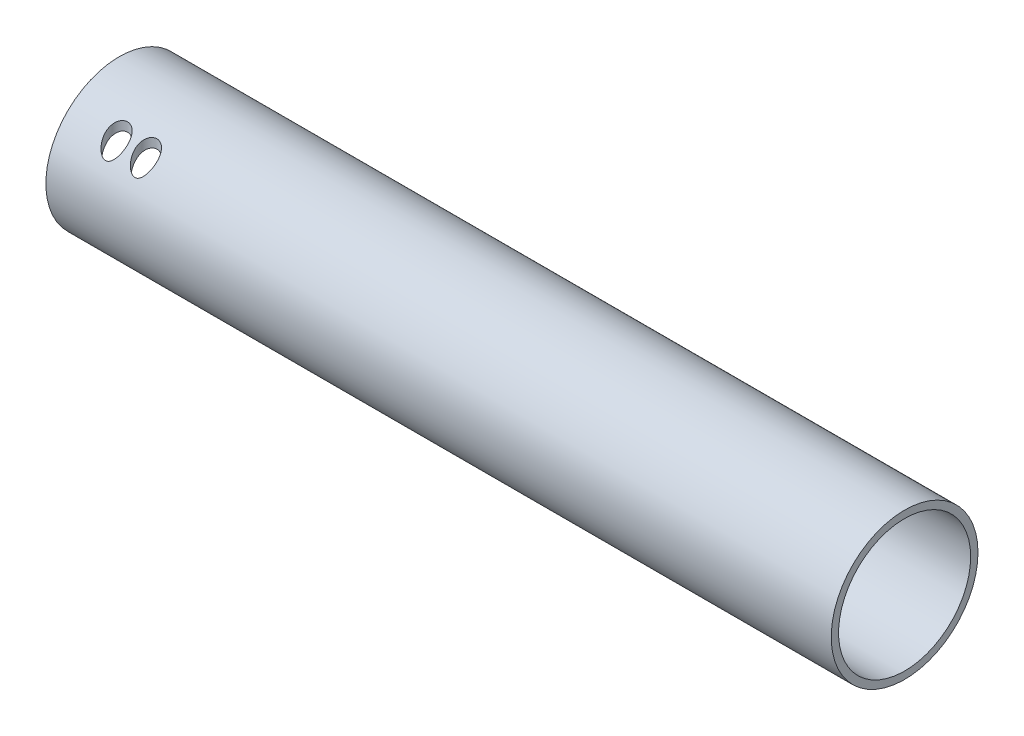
ISO-10303-21;
HEADER;
FILE_DESCRIPTION(('STEP AP214'),'2;1');
FILE_NAME('part.step','',(''),(''),'','','');
FILE_SCHEMA(('AUTOMOTIVE_DESIGN { 1 0 10303 214 1 1 1 1 }'));
ENDSEC;
DATA;
#1=APPLICATION_CONTEXT('core data for automotive mechanical design processes');
#2=APPLICATION_PROTOCOL_DEFINITION('international standard','automotive_design',2000,#1);
#3=PRODUCT_CONTEXT('',#1,'mechanical');
#4=PRODUCT('Part','Part','',(#3));
#5=PRODUCT_RELATED_PRODUCT_CATEGORY('part','',(#4));
#6=PRODUCT_DEFINITION_FORMATION('','',#4);
#7=PRODUCT_DEFINITION_CONTEXT('part definition',#1,'design');
#8=PRODUCT_DEFINITION('design','',#6,#7);
#9=PRODUCT_DEFINITION_SHAPE('','',#8);
#10=(LENGTH_UNIT() NAMED_UNIT(*) SI_UNIT(.MILLI.,.METRE.));
#11=(NAMED_UNIT(*) PLANE_ANGLE_UNIT() SI_UNIT($,.RADIAN.));
#12=(NAMED_UNIT(*) SI_UNIT($,.STERADIAN.) SOLID_ANGLE_UNIT());
#13=UNCERTAINTY_MEASURE_WITH_UNIT(LENGTH_MEASURE(1.E-05),#10,'distance_accuracy_value','');
#14=(GEOMETRIC_REPRESENTATION_CONTEXT(3) GLOBAL_UNCERTAINTY_ASSIGNED_CONTEXT((#13)) GLOBAL_UNIT_ASSIGNED_CONTEXT((#10,
#11,#12)) REPRESENTATION_CONTEXT('',''));
#15=CARTESIAN_POINT('',(0.,0.,0.));
#16=DIRECTION('',(0.,0.,1.));
#17=DIRECTION('',(1.,0.,0.));
#18=AXIS2_PLACEMENT_3D('',#15,#16,#17);
#19=CARTESIAN_POINT('',(214.,0.,0.));
#20=DIRECTION('',(-1.,0.,0.));
#21=DIRECTION('',(0.,0.,1.));
#22=AXIS2_PLACEMENT_3D('',#19,#20,#21);
#23=CYLINDRICAL_SURFACE('',#22,20.);
#24=DIRECTION('',(-1.,0.,0.));
#25=VECTOR('',#24,1.);
#26=CARTESIAN_POINT('',(214.,-5.,-19.3649167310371));
#27=LINE('',#26,#25);
#28=CARTESIAN_POINT('',(163.,-5.,-19.3649167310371));
#29=VERTEX_POINT('',#28);
#30=CARTESIAN_POINT('',(178.,-5.,-19.3649167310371));
#31=VERTEX_POINT('',#30);
#32=EDGE_CURVE('E120',#29,#31,#27,.F.);
#33=ORIENTED_EDGE('',*,*,#32,.T.);
#34=CARTESIAN_POINT('',(178.,-5.,-19.3649167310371));
#35=CARTESIAN_POINT('',(178.068931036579,-5.00000795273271,-19.3649118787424));
#36=CARTESIAN_POINT('',(178.137857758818,-4.99714921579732,-19.3656527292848));
#37=CARTESIAN_POINT('',(178.275200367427,-4.9857598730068,-19.3685895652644));
#38=CARTESIAN_POINT('',(178.343616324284,-4.97723006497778,-19.3707853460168));
#39=CARTESIAN_POINT('',(178.479328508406,-4.95458114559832,-19.3765903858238));
#40=CARTESIAN_POINT('',(178.546626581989,-4.94047246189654,-19.3801970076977));
#41=CARTESIAN_POINT('',(178.679737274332,-4.90679807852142,-19.3887501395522));
#42=CARTESIAN_POINT('',(178.745549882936,-4.887232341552,-19.3936966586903));
#43=CARTESIAN_POINT('',(178.94007416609,-4.82056128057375,-19.4104177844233));
#44=CARTESIAN_POINT('',(179.06599007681,-4.76546226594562,-19.4240792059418));
#45=CARTESIAN_POINT('',(179.30668028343,-4.63572341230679,-19.4554489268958));
#46=CARTESIAN_POINT('',(179.421452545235,-4.56108001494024,-19.4731579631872));
#47=CARTESIAN_POINT('',(179.638901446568,-4.39293548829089,-19.5117828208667));
#48=CARTESIAN_POINT('',(179.741334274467,-4.29913025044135,-19.5327488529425));
#49=CARTESIAN_POINT('',(179.929159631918,-4.09608321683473,-19.5763343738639));
#50=CARTESIAN_POINT('',(180.01454739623,-3.98683711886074,-19.5989543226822));
#51=CARTESIAN_POINT('',(180.16802014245,-3.75289661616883,-19.6451093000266));
#52=CARTESIAN_POINT('',(180.235615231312,-3.62788245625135,-19.6686530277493));
#53=CARTESIAN_POINT('',(180.348708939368,-3.3681065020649,-19.7147970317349));
#54=CARTESIAN_POINT('',(180.39421994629,-3.23335022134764,-19.7373978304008));
#55=CARTESIAN_POINT('',(180.451867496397,-2.9983815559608,-19.7742105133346));
#56=CARTESIAN_POINT('',(180.469880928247,-2.89965152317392,-19.7889362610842));
#57=CARTESIAN_POINT('',(180.493950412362,-2.70066372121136,-19.8170793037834));
#58=CARTESIAN_POINT('',(180.500018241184,-2.60040755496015,-19.8304978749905));
#59=CARTESIAN_POINT('',(180.5,-2.49999999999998,-19.8431348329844));
#60=B_SPLINE_CURVE_WITH_KNOTS('',3,(#34,#35,#36,#37,#38,#39,#40,#41,#42,#43,#44,#45,#46,#47,#48,
#49,#50,#51,#52,#53,#54,#55,#56,#57,#58,#59),.UNSPECIFIED.,.F.,.F.,(4,2,2,2,2,2,2,2,2,2,2,2,4),
(0.,0.206722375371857,0.413415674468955,0.619724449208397,0.826034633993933,1.2383008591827,
1.65064219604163,2.07012235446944,2.48971962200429,2.91988371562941,3.34980623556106,
3.65342333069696,3.95674095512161),.UNSPECIFIED.);
#61=CARTESIAN_POINT('',(180.5,-2.49999999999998,-19.8431348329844));
#62=VERTEX_POINT('',#61);
#63=EDGE_CURVE('E113',#31,#62,#60,.T.);
#64=ORIENTED_EDGE('',*,*,#63,.T.);
#65=CARTESIAN_POINT('',(180.5,0.,0.));
#66=DIRECTION('',(1.,0.,0.));
#67=DIRECTION('',(0.,0.,-1.));
#68=AXIS2_PLACEMENT_3D('',#65,#66,#67);
#69=CIRCLE('',#68,20.);
#70=CARTESIAN_POINT('',(180.5,2.49999999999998,-19.8431348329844));
#71=VERTEX_POINT('',#70);
#72=EDGE_CURVE('E102',#62,#71,#69,.T.);
#73=ORIENTED_EDGE('',*,*,#72,.T.);
#74=CARTESIAN_POINT('',(180.5,2.49999999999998,-19.8431348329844));
#75=CARTESIAN_POINT('',(180.499999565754,2.57115935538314,-19.834171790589));
#76=CARTESIAN_POINT('',(180.496960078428,2.64223375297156,-19.8248257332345));
#77=CARTESIAN_POINT('',(180.484859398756,2.78376471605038,-19.805447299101));
#78=CARTESIAN_POINT('',(180.475798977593,2.8542213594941,-19.7954150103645));
#79=CARTESIAN_POINT('',(180.439717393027,3.06374348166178,-19.7644456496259));
#80=CARTESIAN_POINT('',(180.403795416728,3.20124629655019,-19.7425999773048));
#81=CARTESIAN_POINT('',(180.309357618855,3.46794167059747,-19.6975056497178));
#82=CARTESIAN_POINT('',(180.25083946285,3.59713336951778,-19.674256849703));
#83=CARTESIAN_POINT('',(180.112862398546,3.84378982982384,-19.6275581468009));
#84=CARTESIAN_POINT('',(180.033402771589,3.96125418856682,-19.6041082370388));
#85=CARTESIAN_POINT('',(179.855000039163,4.18204419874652,-19.5582039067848));
#86=CARTESIAN_POINT('',(179.755916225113,4.28525802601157,-19.535758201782));
#87=CARTESIAN_POINT('',(179.54126297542,4.47354621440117,-19.4935045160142));
#88=CARTESIAN_POINT('',(179.425691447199,4.55861826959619,-19.4736968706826));
#89=CARTESIAN_POINT('',(179.182452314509,4.70724482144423,-19.4383036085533));
#90=CARTESIAN_POINT('',(179.054914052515,4.77100160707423,-19.4226785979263));
#91=CARTESIAN_POINT('',(178.790446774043,4.87600210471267,-19.396586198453));
#92=CARTESIAN_POINT('',(178.653526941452,4.91726748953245,-19.3861138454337));
#93=CARTESIAN_POINT('',(178.429604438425,4.96432674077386,-19.3741009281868));
#94=CARTESIAN_POINT('',(178.344221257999,4.97769212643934,-19.3706665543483));
#95=CARTESIAN_POINT('',(178.172573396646,4.99552848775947,-19.3660714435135));
#96=CARTESIAN_POINT('',(178.086309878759,5.00000997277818,-19.3649080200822));
#97=CARTESIAN_POINT('',(178.,5.,-19.3649167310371));
#98=B_SPLINE_CURVE_WITH_KNOTS('',3,(#74,#75,#76,#77,#78,#79,#80,#81,#82,#83,#84,#85,#86,#87,#88,
#89,#90,#91,#92,#93,#94,#95,#96,#97),.UNSPECIFIED.,.F.,.F.,(4,2,2,2,2,2,2,2,2,2,2,4),(0.,
0.215028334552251,0.430029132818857,0.859179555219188,1.28837432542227,1.71758382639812,
2.14999016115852,2.58245142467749,3.01068355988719,3.43850231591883,3.69752491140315,
3.95624090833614),.UNSPECIFIED.);
#99=CARTESIAN_POINT('',(178.,5.,-19.3649167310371));
#100=VERTEX_POINT('',#99);
#101=EDGE_CURVE('E107',#71,#100,#98,.T.);
#102=ORIENTED_EDGE('',*,*,#101,.T.);
#103=DIRECTION('',(-1.,0.,0.));
#104=VECTOR('',#103,1.);
#105=CARTESIAN_POINT('',(214.,5.,-19.3649167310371));
#106=LINE('',#105,#104);
#107=CARTESIAN_POINT('',(163.,5.,-19.3649167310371));
#108=VERTEX_POINT('',#107);
#109=EDGE_CURVE('E213',#100,#108,#106,.T.);
#110=ORIENTED_EDGE('',*,*,#109,.T.);
#111=CARTESIAN_POINT('',(163.,5.,-19.3649167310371));
#112=CARTESIAN_POINT('',(162.931068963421,5.00000795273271,-19.3649118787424));
#113=CARTESIAN_POINT('',(162.862142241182,4.99714921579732,-19.3656527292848));
#114=CARTESIAN_POINT('',(162.724799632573,4.9857598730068,-19.3685895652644));
#115=CARTESIAN_POINT('',(162.656383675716,4.97723006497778,-19.3707853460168));
#116=CARTESIAN_POINT('',(162.520671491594,4.95458114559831,-19.3765903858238));
#117=CARTESIAN_POINT('',(162.453373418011,4.94047246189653,-19.3801970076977));
#118=CARTESIAN_POINT('',(162.320262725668,4.90679807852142,-19.3887501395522));
#119=CARTESIAN_POINT('',(162.254450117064,4.887232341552,-19.3936966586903));
#120=CARTESIAN_POINT('',(162.05992583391,4.82056128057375,-19.4104177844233));
#121=CARTESIAN_POINT('',(161.93400992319,4.7654622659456,-19.4240792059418));
#122=CARTESIAN_POINT('',(161.69331971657,4.63572341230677,-19.4554489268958));
#123=CARTESIAN_POINT('',(161.578547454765,4.56108001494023,-19.4731579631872));
#124=CARTESIAN_POINT('',(161.361098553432,4.39293548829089,-19.5117828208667));
#125=CARTESIAN_POINT('',(161.258665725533,4.29913025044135,-19.5327488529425));
#126=CARTESIAN_POINT('',(161.070840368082,4.09608321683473,-19.5763343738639));
#127=CARTESIAN_POINT('',(160.98545260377,3.98683711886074,-19.5989543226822));
#128=CARTESIAN_POINT('',(160.83197985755,3.75289661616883,-19.6451093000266));
#129=CARTESIAN_POINT('',(160.764384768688,3.62788245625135,-19.6686530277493));
#130=CARTESIAN_POINT('',(160.651291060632,3.3681065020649,-19.7147970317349));
#131=CARTESIAN_POINT('',(160.60578005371,3.23335022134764,-19.7373978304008));
#132=CARTESIAN_POINT('',(160.548132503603,2.9983815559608,-19.7742105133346));
#133=CARTESIAN_POINT('',(160.530119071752,2.89965152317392,-19.7889362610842));
#134=CARTESIAN_POINT('',(160.506049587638,2.70066372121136,-19.8170793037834));
#135=CARTESIAN_POINT('',(160.499981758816,2.60040755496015,-19.8304978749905));
#136=CARTESIAN_POINT('',(160.5,2.49999999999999,-19.8431348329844));
#137=B_SPLINE_CURVE_WITH_KNOTS('',3,(#111,#112,#113,#114,#115,#116,#117,#118,#119,#120,#121,
#122,#123,#124,#125,#126,#127,#128,#129,#130,#131,#132,#133,#134,#135,#136),.UNSPECIFIED.,.F.,
.F.,(4,2,2,2,2,2,2,2,2,2,2,2,4),(0.,0.206722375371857,0.413415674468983,0.619724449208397,
0.826034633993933,1.23830085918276,1.65064219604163,2.07012235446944,2.48971962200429,
2.91988371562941,3.34980623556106,3.65342333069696,3.95674095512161),.UNSPECIFIED.);
#138=CARTESIAN_POINT('',(160.5,2.49999999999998,-19.8431348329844));
#139=VERTEX_POINT('',#138);
#140=EDGE_CURVE('E207',#108,#139,#137,.T.);
#141=ORIENTED_EDGE('',*,*,#140,.T.);
#142=CARTESIAN_POINT('',(160.5,0.,0.));
#143=DIRECTION('',(-1.,0.,0.));
#144=DIRECTION('',(0.,0.,1.));
#145=AXIS2_PLACEMENT_3D('',#142,#143,#144);
#146=CIRCLE('',#145,20.);
#147=CARTESIAN_POINT('',(160.5,-2.49999999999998,-19.8431348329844));
#148=VERTEX_POINT('',#147);
#149=EDGE_CURVE('E204',#139,#148,#146,.T.);
#150=ORIENTED_EDGE('',*,*,#149,.T.);
#151=CARTESIAN_POINT('',(160.5,-2.49999999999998,-19.8431348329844));
#152=CARTESIAN_POINT('',(160.500000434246,-2.57115935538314,-19.834171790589));
#153=CARTESIAN_POINT('',(160.503039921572,-2.64223375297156,-19.8248257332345));
#154=CARTESIAN_POINT('',(160.515140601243,-2.78376471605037,-19.805447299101));
#155=CARTESIAN_POINT('',(160.524201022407,-2.8542213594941,-19.7954150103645));
#156=CARTESIAN_POINT('',(160.560282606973,-3.06374348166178,-19.7644456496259));
#157=CARTESIAN_POINT('',(160.596204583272,-3.20124629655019,-19.7425999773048));
#158=CARTESIAN_POINT('',(160.690642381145,-3.46794167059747,-19.6975056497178));
#159=CARTESIAN_POINT('',(160.74916053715,-3.59713336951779,-19.674256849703));
#160=CARTESIAN_POINT('',(160.887137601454,-3.84378982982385,-19.6275581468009));
#161=CARTESIAN_POINT('',(160.966597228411,-3.96125418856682,-19.6041082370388));
#162=CARTESIAN_POINT('',(161.144999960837,-4.18204419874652,-19.5582039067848));
#163=CARTESIAN_POINT('',(161.244083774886,-4.28525802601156,-19.535758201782));
#164=CARTESIAN_POINT('',(161.45873702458,-4.47354621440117,-19.4935045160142));
#165=CARTESIAN_POINT('',(161.574308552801,-4.55861826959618,-19.4736968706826));
#166=CARTESIAN_POINT('',(161.817547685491,-4.70724482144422,-19.4383036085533));
#167=CARTESIAN_POINT('',(161.945085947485,-4.77100160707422,-19.4226785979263));
#168=CARTESIAN_POINT('',(162.209553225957,-4.87600210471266,-19.396586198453));
#169=CARTESIAN_POINT('',(162.346473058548,-4.91726748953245,-19.3861138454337));
#170=CARTESIAN_POINT('',(162.570395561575,-4.96432674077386,-19.3741009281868));
#171=CARTESIAN_POINT('',(162.655778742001,-4.97769212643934,-19.3706665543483));
#172=CARTESIAN_POINT('',(162.827426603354,-4.99552848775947,-19.3660714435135));
#173=CARTESIAN_POINT('',(162.913690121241,-5.00000997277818,-19.3649080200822));
#174=CARTESIAN_POINT('',(163.,-5.,-19.3649167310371));
#175=B_SPLINE_CURVE_WITH_KNOTS('',3,(#151,#152,#153,#154,#155,#156,#157,#158,#159,#160,#161,
#162,#163,#164,#165,#166,#167,#168,#169,#170,#171,#172,#173,#174),.UNSPECIFIED.,.F.,.F.,(4,2,2,
2,2,2,2,2,2,2,2,4),(0.,0.215028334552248,0.430029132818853,0.859179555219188,1.28837432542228,
1.71758382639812,2.14999016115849,2.58245142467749,3.01068355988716,3.43850231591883,
3.69752491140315,3.95624090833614),.UNSPECIFIED.);
#176=EDGE_CURVE('E126',#148,#29,#175,.T.);
#177=ORIENTED_EDGE('',*,*,#176,.T.);
#178=EDGE_LOOP('',(#33,#64,#73,#102,#110,#141,#150,#177));
#179=FACE_BOUND('',#178,.T.);
#180=CARTESIAN_POINT('',(13.244791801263,16.7196778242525,10.9750796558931));
#181=CARTESIAN_POINT('',(13.0980470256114,16.7196725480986,10.9750909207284));
#182=CARTESIAN_POINT('',(12.9511233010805,16.7125786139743,10.9859185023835));
#183=CARTESIAN_POINT('',(12.6616041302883,16.6844025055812,11.0286596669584));
#184=CARTESIAN_POINT('',(12.5190170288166,16.6632949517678,11.0606115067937));
#185=CARTESIAN_POINT('',(12.24281641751,16.6078484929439,11.1436901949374));
#186=CARTESIAN_POINT('',(12.10917490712,16.5735533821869,11.1947535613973));
#187=CARTESIAN_POINT('',(11.853559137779,16.4927646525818,11.3134363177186));
#188=CARTESIAN_POINT('',(11.7315827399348,16.4462732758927,11.3810526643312));
#189=CARTESIAN_POINT('',(11.4959942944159,16.3398897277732,11.5332994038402));
#190=CARTESIAN_POINT('',(11.3830426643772,16.2794713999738,11.6185789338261));
#191=CARTESIAN_POINT('',(11.1735552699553,16.1481645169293,11.8003968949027));
#192=CARTESIAN_POINT('',(11.0770256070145,16.0772720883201,11.8969394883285));
#193=CARTESIAN_POINT('',(10.8879294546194,15.9155408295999,12.1126469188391));
#194=CARTESIAN_POINT('',(10.7979910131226,15.823300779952,12.2330581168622));
#195=CARTESIAN_POINT('',(10.6396822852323,15.6292032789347,12.4800960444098));
#196=CARTESIAN_POINT('',(10.5713295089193,15.5273381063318,12.606727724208));
#197=CARTESIAN_POINT('',(10.4253868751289,15.2618898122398,12.9281579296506));
#198=CARTESIAN_POINT('',(10.3608521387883,15.0933169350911,13.1247972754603));
#199=CARTESIAN_POINT('',(10.2732682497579,14.7437414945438,13.5163353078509));
#200=CARTESIAN_POINT('',(10.2502934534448,14.5627172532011,13.7112302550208));
#201=CARTESIAN_POINT('',(10.242719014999,14.259744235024,14.0245736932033));
#202=CARTESIAN_POINT('',(10.2472432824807,14.1401157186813,14.1451708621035));
#203=CARTESIAN_POINT('',(10.2702151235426,13.8984660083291,14.3826740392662));
#204=CARTESIAN_POINT('',(10.2886669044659,13.7764441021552,14.4995789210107));
#205=CARTESIAN_POINT('',(10.3387454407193,13.5306364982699,14.729231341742));
#206=CARTESIAN_POINT('',(10.3704055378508,13.4068471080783,14.8419675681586));
#207=CARTESIAN_POINT('',(10.4463444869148,13.1587011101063,15.0624074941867));
#208=CARTESIAN_POINT('',(10.4906213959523,13.0343445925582,15.1701119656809));
#209=CARTESIAN_POINT('',(10.5922423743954,12.7842734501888,15.3814668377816));
#210=CARTESIAN_POINT('',(10.6497590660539,12.6585638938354,15.4850403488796));
#211=CARTESIAN_POINT('',(10.7776396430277,12.4086301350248,15.6860325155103));
#212=CARTESIAN_POINT('',(10.8480094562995,12.2844066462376,15.7834483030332));
#213=CARTESIAN_POINT('',(11.0017705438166,12.0396202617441,15.9709484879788));
#214=CARTESIAN_POINT('',(11.0850989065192,11.9190428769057,16.0610652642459));
#215=CARTESIAN_POINT('',(11.2660170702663,11.6832204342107,16.2334105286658));
#216=CARTESIAN_POINT('',(11.3635888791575,11.5679688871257,16.3156487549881));
#217=CARTESIAN_POINT('',(11.5544873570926,11.367414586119,16.4558152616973));
#218=CARTESIAN_POINT('',(11.6450198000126,11.2806156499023,16.5153766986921));
#219=CARTESIAN_POINT('',(11.8378825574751,11.115323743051,16.6270718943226));
#220=CARTESIAN_POINT('',(11.9402260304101,11.0368402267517,16.6791972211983));
#221=CARTESIAN_POINT('',(12.1595629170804,10.8914617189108,16.7744957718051));
#222=CARTESIAN_POINT('',(12.2767480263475,10.8247521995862,16.8175275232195));
#223=CARTESIAN_POINT('',(12.4621288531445,10.7396522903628,16.871900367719));
#224=CARTESIAN_POINT('',(12.5254393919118,10.713802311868,16.8883149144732));
#225=CARTESIAN_POINT('',(12.6549880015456,10.6680087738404,16.9172786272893));
#226=CARTESIAN_POINT('',(12.7212238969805,10.6480609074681,16.9298306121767));
#227=CARTESIAN_POINT('',(12.8766221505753,10.6099852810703,16.9537275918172));
#228=CARTESIAN_POINT('',(12.9666360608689,10.5942517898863,16.9635472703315));
#229=CARTESIAN_POINT('',(13.1484763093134,10.5760288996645,16.9749149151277));
#230=CARTESIAN_POINT('',(13.2403013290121,10.5735301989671,16.9764686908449));
#231=CARTESIAN_POINT('',(13.4230326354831,10.5820254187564,16.9711743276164));
#232=CARTESIAN_POINT('',(13.5139392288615,10.5930146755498,16.9643290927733));
#233=CARTESIAN_POINT('',(13.6924413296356,10.627318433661,16.9428598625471));
#234=CARTESIAN_POINT('',(13.7800336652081,10.6506444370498,16.9282286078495));
#235=CARTESIAN_POINT('',(13.9810943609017,10.7179355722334,16.8857319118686));
#236=CARTESIAN_POINT('',(14.0924609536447,10.7663143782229,16.8549937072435));
#237=CARTESIAN_POINT('',(14.3047482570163,10.8769102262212,16.7838354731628));
#238=CARTESIAN_POINT('',(14.4056430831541,10.9391604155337,16.7433922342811));
#239=CARTESIAN_POINT('',(14.5783493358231,11.0600430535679,16.6637220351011));
#240=CARTESIAN_POINT('',(14.6519846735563,11.1169922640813,16.6258109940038));
#241=CARTESIAN_POINT('',(14.7931107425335,11.2355328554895,16.5459333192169));
#242=CARTESIAN_POINT('',(14.8605976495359,11.2971270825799,16.5039641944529));
#243=CARTESIAN_POINT('',(14.9899481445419,11.4238548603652,16.4165002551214));
#244=CARTESIAN_POINT('',(15.0518017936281,11.488994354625,16.3709994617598));
#245=CARTESIAN_POINT('',(15.1701868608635,11.6218678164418,16.2769415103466));
#246=CARTESIAN_POINT('',(15.2267165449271,11.6896026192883,16.2283833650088));
#247=CARTESIAN_POINT('',(15.3679586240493,11.8691638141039,16.0978785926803));
#248=CARTESIAN_POINT('',(15.4486795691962,11.98254169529,16.0137275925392));
#249=CARTESIAN_POINT('',(15.5981682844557,12.2123566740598,15.8391669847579));
#250=CARTESIAN_POINT('',(15.6669292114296,12.3287954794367,15.7487538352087));
#251=CARTESIAN_POINT('',(15.7930694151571,12.563449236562,15.5622051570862));
#252=CARTESIAN_POINT('',(15.8504374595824,12.6816658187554,15.4660641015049));
#253=CARTESIAN_POINT('',(15.9538732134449,12.9186879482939,15.2686375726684));
#254=CARTESIAN_POINT('',(15.9999431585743,13.0374933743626,15.1673531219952));
#255=CARTESIAN_POINT('',(16.0819623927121,13.2786537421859,14.9567306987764));
#256=CARTESIAN_POINT('',(16.1175408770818,13.4010006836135,14.8472387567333));
#257=CARTESIAN_POINT('',(16.1761128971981,13.6445864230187,14.6236997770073));
#258=CARTESIAN_POINT('',(16.1991045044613,13.7658250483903,14.5096520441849));
#259=CARTESIAN_POINT('',(16.2317729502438,14.0061697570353,14.2777810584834));
#260=CARTESIAN_POINT('',(16.241469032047,14.1252786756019,14.1599635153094));
#261=CARTESIAN_POINT('',(16.2466830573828,14.3605994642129,13.9212534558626));
#262=CARTESIAN_POINT('',(16.2422060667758,14.4768123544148,13.8003620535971));
#263=CARTESIAN_POINT('',(16.2121904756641,14.7599466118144,13.4983216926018));
#264=CARTESIAN_POINT('',(16.1776410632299,14.9246746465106,13.3158807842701));
#265=CARTESIAN_POINT('',(16.0711024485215,15.2420274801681,12.9514008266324));
#266=CARTESIAN_POINT('',(15.9991606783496,15.3946673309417,12.769361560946));
#267=CARTESIAN_POINT('',(15.8329572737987,15.6537186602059,12.4496762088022));
#268=CARTESIAN_POINT('',(15.7462983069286,15.7631910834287,12.3105819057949));
#269=CARTESIAN_POINT('',(15.5455946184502,15.9688066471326,12.0426585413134));
#270=CARTESIAN_POINT('',(15.431582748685,16.0649655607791,11.9138174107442));
#271=CARTESIAN_POINT('',(15.1971435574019,16.2265030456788,11.6925720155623));
#272=CARTESIAN_POINT('',(15.0808210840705,16.2943435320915,11.5976555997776));
#273=CARTESIAN_POINT('',(14.8931294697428,16.3860674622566,11.4673290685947));
#274=CARTESIAN_POINT('',(14.8283189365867,16.4149844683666,11.4258724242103));
#275=CARTESIAN_POINT('',(14.6945918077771,16.4692464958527,11.3475189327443));
#276=CARTESIAN_POINT('',(14.6256769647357,16.4945930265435,11.3106201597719));
#277=CARTESIAN_POINT('',(14.4836119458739,16.541672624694,11.2416558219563));
#278=CARTESIAN_POINT('',(14.4104347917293,16.5633782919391,11.2096270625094));
#279=CARTESIAN_POINT('',(14.2608407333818,16.6027453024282,11.151237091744));
#280=CARTESIAN_POINT('',(14.1844254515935,16.6204086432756,11.124873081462));
#281=CARTESIAN_POINT('',(14.0290703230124,16.6515040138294,11.0782759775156));
#282=CARTESIAN_POINT('',(13.9501354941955,16.6649439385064,11.0580314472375));
#283=CARTESIAN_POINT('',(13.7903266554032,16.6874969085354,11.0239677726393));
#284=CARTESIAN_POINT('',(13.7094538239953,16.696612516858,11.0101448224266));
#285=CARTESIAN_POINT('',(13.5646019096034,16.7088967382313,10.991490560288));
#286=CARTESIAN_POINT('',(13.5008629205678,16.7129368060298,10.9853436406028));
#287=CARTESIAN_POINT('',(13.3730246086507,16.7183284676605,10.9771357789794));
#288=CARTESIAN_POINT('',(13.3089252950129,16.7196801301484,10.9750747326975));
#289=CARTESIAN_POINT('',(13.244791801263,16.7196778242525,10.9750796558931));
#290=B_SPLINE_CURVE_WITH_KNOTS('',3,(#180,#181,#182,#183,#184,#185,#186,#187,#188,#189,#190,
#191,#192,#193,#194,#195,#196,#197,#198,#199,#200,#201,#202,#203,#204,#205,#206,#207,#208,#209,
#210,#211,#212,#213,#214,#215,#216,#217,#218,#219,#220,#221,#222,#223,#224,#225,#226,#227,#228,
#229,#230,#231,#232,#233,#234,#235,#236,#237,#238,#239,#240,#241,#242,#243,#244,#245,#246,#247,
#248,#249,#250,#251,#252,#253,#254,#255,#256,#257,#258,#259,#260,#261,#262,#263,#264,#265,#266,
#267,#268,#269,#270,#271,#272,#273,#274,#275,#276,#277,#278,#279,#280,#281,#282,#283,#284,#285,
#286,#287,#288,#289),.UNSPECIFIED.,.T.,.F.,(4,2,2,2,2,2,2,2,2,2,2,2,2,2,2,2,2,2,2,2,2,2,2,2,2,2,
2,2,2,2,2,2,2,2,2,2,2,2,2,2,2,2,2,2,2,2,2,2,2,2,2,2,2,2,4),(0.,0.439987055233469,
0.880773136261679,1.32010788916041,1.75936193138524,2.21921319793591,2.67923494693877,
3.20630242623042,3.73379636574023,4.53020295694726,5.32803302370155,5.83723227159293,
6.34658540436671,6.85723215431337,7.36780031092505,7.88544567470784,8.40333038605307,
8.91877512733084,9.43357431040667,9.84934002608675,10.2655734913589,10.6878704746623,
10.898502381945,11.1089802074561,11.3834048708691,11.6576366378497,11.9317736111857,
12.2061666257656,12.5798199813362,12.9543759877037,13.255502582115,13.5568152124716,
13.8586495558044,14.1605818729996,14.6477846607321,15.1352652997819,15.6232241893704,
16.1110864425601,16.6145516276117,17.1180939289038,17.6209066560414,18.1235396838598,
18.8654219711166,19.6063654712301,20.1953620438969,20.7836547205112,21.2756521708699,
21.521963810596,21.7681710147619,22.0161551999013,22.2640165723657,22.5114118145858,
22.7586602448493,22.9509575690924,23.1432499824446),.UNSPECIFIED.);
#291=CARTESIAN_POINT('',(13.244791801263,16.7196778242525,10.9750796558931));
#292=VERTEX_POINT('',#291);
#293=EDGE_CURVE('E267',#292,#292,#290,.T.);
#294=ORIENTED_EDGE('',*,*,#293,.F.);
#295=EDGE_LOOP('',(#294));
#296=FACE_BOUND('',#295,.T.);
#297=CARTESIAN_POINT('',(214.,0.,0.));
#298=DIRECTION('',(1.,0.,0.));
#299=DIRECTION('',(0.,0.,-1.));
#300=AXIS2_PLACEMENT_3D('',#297,#298,#299);
#301=CIRCLE('',#300,20.);
#302=CARTESIAN_POINT('',(214.,0.,-20.));
#303=VERTEX_POINT('',#302);
#304=EDGE_CURVE('E254',#303,#303,#301,.T.);
#305=ORIENTED_EDGE('',*,*,#304,.F.);
#306=EDGE_LOOP('',(#305));
#307=FACE_BOUND('',#306,.T.);
#308=CARTESIAN_POINT('',(0.,0.,0.));
#309=DIRECTION('',(1.,0.,0.));
#310=DIRECTION('',(0.,0.,-1.));
#311=AXIS2_PLACEMENT_3D('',#308,#309,#310);
#312=CIRCLE('',#311,20.);
#313=CARTESIAN_POINT('',(0.,0.,-20.));
#314=VERTEX_POINT('',#313);
#315=EDGE_CURVE('E257',#314,#314,#312,.T.);
#316=ORIENTED_EDGE('',*,*,#315,.T.);
#317=EDGE_LOOP('',(#316));
#318=FACE_BOUND('',#317,.T.);
#319=CARTESIAN_POINT('',(21.244791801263,16.7196778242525,10.9750796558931));
#320=CARTESIAN_POINT('',(21.0980470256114,16.7196725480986,10.9750909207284));
#321=CARTESIAN_POINT('',(20.9511233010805,16.7125786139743,10.9859185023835));
#322=CARTESIAN_POINT('',(20.6616041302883,16.6844025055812,11.0286596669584));
#323=CARTESIAN_POINT('',(20.5190170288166,16.6632949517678,11.0606115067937));
#324=CARTESIAN_POINT('',(20.24281641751,16.6078484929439,11.1436901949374));
#325=CARTESIAN_POINT('',(20.10917490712,16.5735533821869,11.1947535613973));
#326=CARTESIAN_POINT('',(19.853559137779,16.4927646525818,11.3134363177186));
#327=CARTESIAN_POINT('',(19.7315827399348,16.4462732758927,11.3810526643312));
#328=CARTESIAN_POINT('',(19.4959942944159,16.3398897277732,11.5332994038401));
#329=CARTESIAN_POINT('',(19.3830426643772,16.2794713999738,11.6185789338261));
#330=CARTESIAN_POINT('',(19.1735552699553,16.1481645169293,11.8003968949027));
#331=CARTESIAN_POINT('',(19.0770256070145,16.0772720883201,11.8969394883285));
#332=CARTESIAN_POINT('',(18.8879294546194,15.9155408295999,12.1126469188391));
#333=CARTESIAN_POINT('',(18.7979910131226,15.823300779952,12.2330581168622));
#334=CARTESIAN_POINT('',(18.6396822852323,15.6292032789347,12.4800960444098));
#335=CARTESIAN_POINT('',(18.5713295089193,15.5273381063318,12.606727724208));
#336=CARTESIAN_POINT('',(18.4253868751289,15.2618898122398,12.9281579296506));
#337=CARTESIAN_POINT('',(18.3608521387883,15.0933169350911,13.1247972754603));
#338=CARTESIAN_POINT('',(18.2732682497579,14.7437414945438,13.5163353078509));
#339=CARTESIAN_POINT('',(18.2502934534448,14.5627172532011,13.7112302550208));
#340=CARTESIAN_POINT('',(18.242719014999,14.259744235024,14.0245736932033));
#341=CARTESIAN_POINT('',(18.2472432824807,14.1401157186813,14.1451708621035));
#342=CARTESIAN_POINT('',(18.2702151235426,13.8984660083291,14.3826740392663));
#343=CARTESIAN_POINT('',(18.2886669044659,13.7764441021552,14.4995789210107));
#344=CARTESIAN_POINT('',(18.3387454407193,13.5306364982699,14.729231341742));
#345=CARTESIAN_POINT('',(18.3704055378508,13.4068471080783,14.8419675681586));
#346=CARTESIAN_POINT('',(18.4463444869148,13.1587011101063,15.0624074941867));
#347=CARTESIAN_POINT('',(18.4906213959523,13.0343445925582,15.1701119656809));
#348=CARTESIAN_POINT('',(18.5922423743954,12.7842734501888,15.3814668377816));
#349=CARTESIAN_POINT('',(18.6497590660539,12.6585638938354,15.4850403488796));
#350=CARTESIAN_POINT('',(18.7776396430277,12.4086301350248,15.6860325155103));
#351=CARTESIAN_POINT('',(18.8480094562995,12.2844066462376,15.7834483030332));
#352=CARTESIAN_POINT('',(19.0017705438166,12.0396202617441,15.9709484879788));
#353=CARTESIAN_POINT('',(19.0850989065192,11.9190428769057,16.0610652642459));
#354=CARTESIAN_POINT('',(19.2660170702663,11.6832204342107,16.2334105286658));
#355=CARTESIAN_POINT('',(19.3635888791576,11.5679688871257,16.3156487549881));
#356=CARTESIAN_POINT('',(19.5544873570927,11.367414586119,16.4558152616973));
#357=CARTESIAN_POINT('',(19.6450198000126,11.2806156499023,16.5153766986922));
#358=CARTESIAN_POINT('',(19.8378825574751,11.115323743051,16.6270718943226));
#359=CARTESIAN_POINT('',(19.9402260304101,11.0368402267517,16.6791972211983));
#360=CARTESIAN_POINT('',(20.1595629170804,10.8914617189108,16.7744957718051));
#361=CARTESIAN_POINT('',(20.2767480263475,10.8247521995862,16.8175275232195));
#362=CARTESIAN_POINT('',(20.4621288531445,10.7396522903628,16.871900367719));
#363=CARTESIAN_POINT('',(20.5254393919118,10.713802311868,16.8883149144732));
#364=CARTESIAN_POINT('',(20.6549880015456,10.6680087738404,16.9172786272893));
#365=CARTESIAN_POINT('',(20.7212238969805,10.6480609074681,16.9298306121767));
#366=CARTESIAN_POINT('',(20.8766221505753,10.6099852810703,16.9537275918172));
#367=CARTESIAN_POINT('',(20.9666360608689,10.5942517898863,16.9635472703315));
#368=CARTESIAN_POINT('',(21.1484763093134,10.5760288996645,16.9749149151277));
#369=CARTESIAN_POINT('',(21.2403013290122,10.5735301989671,16.9764686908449));
#370=CARTESIAN_POINT('',(21.4230326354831,10.5820254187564,16.9711743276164));
#371=CARTESIAN_POINT('',(21.5139392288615,10.5930146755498,16.9643290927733));
#372=CARTESIAN_POINT('',(21.6924413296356,10.627318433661,16.9428598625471));
#373=CARTESIAN_POINT('',(21.7800336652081,10.6506444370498,16.9282286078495));
#374=CARTESIAN_POINT('',(21.9810943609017,10.7179355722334,16.8857319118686));
#375=CARTESIAN_POINT('',(22.0924609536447,10.7663143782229,16.8549937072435));
#376=CARTESIAN_POINT('',(22.3047482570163,10.8769102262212,16.7838354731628));
#377=CARTESIAN_POINT('',(22.4056430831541,10.9391604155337,16.7433922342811));
#378=CARTESIAN_POINT('',(22.5783493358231,11.0600430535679,16.6637220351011));
#379=CARTESIAN_POINT('',(22.6519846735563,11.1169922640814,16.6258109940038));
#380=CARTESIAN_POINT('',(22.7931107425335,11.2355328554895,16.5459333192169));
#381=CARTESIAN_POINT('',(22.8605976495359,11.2971270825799,16.5039641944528));
#382=CARTESIAN_POINT('',(22.989948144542,11.4238548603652,16.4165002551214));
#383=CARTESIAN_POINT('',(23.0518017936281,11.488994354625,16.3709994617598));
#384=CARTESIAN_POINT('',(23.1701868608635,11.6218678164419,16.2769415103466));
#385=CARTESIAN_POINT('',(23.2267165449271,11.6896026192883,16.2283833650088));
#386=CARTESIAN_POINT('',(23.3679586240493,11.869163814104,16.0978785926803));
#387=CARTESIAN_POINT('',(23.4486795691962,11.9825416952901,16.0137275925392));
#388=CARTESIAN_POINT('',(23.5981682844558,12.2123566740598,15.8391669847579));
#389=CARTESIAN_POINT('',(23.6669292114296,12.3287954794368,15.7487538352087));
#390=CARTESIAN_POINT('',(23.7930694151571,12.563449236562,15.5622051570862));
#391=CARTESIAN_POINT('',(23.8504374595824,12.6816658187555,15.4660641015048));
#392=CARTESIAN_POINT('',(23.953873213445,12.918687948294,15.2686375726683));
#393=CARTESIAN_POINT('',(23.9999431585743,13.0374933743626,15.1673531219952));
#394=CARTESIAN_POINT('',(24.0819623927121,13.2786537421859,14.9567306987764));
#395=CARTESIAN_POINT('',(24.1175408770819,13.4010006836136,14.8472387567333));
#396=CARTESIAN_POINT('',(24.1761128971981,13.6445864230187,14.6236997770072));
#397=CARTESIAN_POINT('',(24.1991045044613,13.7658250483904,14.5096520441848));
#398=CARTESIAN_POINT('',(24.2317729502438,14.0061697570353,14.2777810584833));
#399=CARTESIAN_POINT('',(24.241469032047,14.1252786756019,14.1599635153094));
#400=CARTESIAN_POINT('',(24.2466830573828,14.360599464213,13.9212534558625));
#401=CARTESIAN_POINT('',(24.2422060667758,14.4768123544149,13.800362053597));
#402=CARTESIAN_POINT('',(24.2121904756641,14.7599466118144,13.4983216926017));
#403=CARTESIAN_POINT('',(24.1776410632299,14.9246746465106,13.31588078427));
#404=CARTESIAN_POINT('',(24.0711024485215,15.2420274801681,12.9514008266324));
#405=CARTESIAN_POINT('',(23.9991606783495,15.3946673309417,12.769361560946));
#406=CARTESIAN_POINT('',(23.8329572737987,15.653718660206,12.4496762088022));
#407=CARTESIAN_POINT('',(23.7462983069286,15.7631910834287,12.3105819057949));
#408=CARTESIAN_POINT('',(23.5455946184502,15.9688066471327,12.0426585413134));
#409=CARTESIAN_POINT('',(23.4315827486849,16.0649655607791,11.9138174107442));
#410=CARTESIAN_POINT('',(23.1971435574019,16.2265030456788,11.6925720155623));
#411=CARTESIAN_POINT('',(23.0808210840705,16.2943435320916,11.5976555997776));
#412=CARTESIAN_POINT('',(22.8931294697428,16.3860674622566,11.4673290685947));
#413=CARTESIAN_POINT('',(22.8283189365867,16.4149844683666,11.4258724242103));
#414=CARTESIAN_POINT('',(22.694591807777,16.4692464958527,11.3475189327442));
#415=CARTESIAN_POINT('',(22.6256769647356,16.4945930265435,11.3106201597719));
#416=CARTESIAN_POINT('',(22.4836119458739,16.541672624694,11.2416558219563));
#417=CARTESIAN_POINT('',(22.4104347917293,16.5633782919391,11.2096270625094));
#418=CARTESIAN_POINT('',(22.2608407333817,16.6027453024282,11.151237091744));
#419=CARTESIAN_POINT('',(22.1844254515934,16.6204086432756,11.124873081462));
#420=CARTESIAN_POINT('',(22.0290703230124,16.6515040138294,11.0782759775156));
#421=CARTESIAN_POINT('',(21.9501354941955,16.6649439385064,11.0580314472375));
#422=CARTESIAN_POINT('',(21.7903266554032,16.6874969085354,11.0239677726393));
#423=CARTESIAN_POINT('',(21.7094538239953,16.696612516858,11.0101448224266));
#424=CARTESIAN_POINT('',(21.5646019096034,16.7088967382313,10.991490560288));
#425=CARTESIAN_POINT('',(21.5008629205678,16.7129368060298,10.9853436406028));
#426=CARTESIAN_POINT('',(21.3730246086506,16.7183284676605,10.9771357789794));
#427=CARTESIAN_POINT('',(21.3089252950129,16.7196801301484,10.9750747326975));
#428=CARTESIAN_POINT('',(21.244791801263,16.7196778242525,10.9750796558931));
#429=B_SPLINE_CURVE_WITH_KNOTS('',3,(#319,#320,#321,#322,#323,#324,#325,#326,#327,#328,#329,
#330,#331,#332,#333,#334,#335,#336,#337,#338,#339,#340,#341,#342,#343,#344,#345,#346,#347,#348,
#349,#350,#351,#352,#353,#354,#355,#356,#357,#358,#359,#360,#361,#362,#363,#364,#365,#366,#367,
#368,#369,#370,#371,#372,#373,#374,#375,#376,#377,#378,#379,#380,#381,#382,#383,#384,#385,#386,
#387,#388,#389,#390,#391,#392,#393,#394,#395,#396,#397,#398,#399,#400,#401,#402,#403,#404,#405,
#406,#407,#408,#409,#410,#411,#412,#413,#414,#415,#416,#417,#418,#419,#420,#421,#422,#423,#424,
#425,#426,#427,#428),.UNSPECIFIED.,.T.,.F.,(4,2,2,2,2,2,2,2,2,2,2,2,2,2,2,2,2,2,2,2,2,2,2,2,2,2,
2,2,2,2,2,2,2,2,2,2,2,2,2,2,2,2,2,2,2,2,2,2,2,2,2,2,2,2,4),(0.,0.439987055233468,
0.880773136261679,1.32010788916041,1.75936193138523,2.21921319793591,2.67923494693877,
3.20630242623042,3.73379636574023,4.53020295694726,5.32803302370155,5.83723227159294,
6.34658540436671,6.85723215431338,7.36780031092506,7.88544567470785,8.40333038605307,
8.91877512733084,9.43357431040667,9.84934002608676,10.2655734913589,10.6878704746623,
10.898502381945,11.1089802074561,11.3834048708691,11.6576366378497,11.9317736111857,
12.2061666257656,12.5798199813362,12.9543759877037,13.255502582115,13.5568152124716,
13.8586495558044,14.1605818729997,14.6477846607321,15.1352652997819,15.6232241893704,
16.1110864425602,16.6145516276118,17.1180939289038,17.6209066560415,18.1235396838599,
18.8654219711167,19.6063654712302,20.195362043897,20.7836547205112,21.2756521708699,
21.521963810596,21.768171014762,22.0161551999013,22.2640165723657,22.5114118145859,
22.7586602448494,22.9509575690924,23.1432499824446),.UNSPECIFIED.);
#430=CARTESIAN_POINT('',(21.244791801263,16.7196778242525,10.9750796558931));
#431=VERTEX_POINT('',#430);
#432=EDGE_CURVE('E124',#431,#431,#429,.T.);
#433=ORIENTED_EDGE('',*,*,#432,.F.);
#434=EDGE_LOOP('',(#433));
#435=FACE_BOUND('',#434,.T.);
#436=ADVANCED_FACE('F35',(#179,#296,#307,#318,#435),#23,.T.);
#437=CARTESIAN_POINT('',(0.,0.,0.));
#438=DIRECTION('',(1.,0.,0.));
#439=DIRECTION('',(0.,0.,-1.));
#440=AXIS2_PLACEMENT_3D('',#437,#438,#439);
#441=CYLINDRICAL_SURFACE('',#440,18.);
#442=CARTESIAN_POINT('',(180.5,0.,0.));
#443=DIRECTION('',(1.,0.,0.));
#444=DIRECTION('',(0.,0.,-1.));
#445=AXIS2_PLACEMENT_3D('',#442,#443,#444);
#446=CIRCLE('',#445,18.);
#447=CARTESIAN_POINT('',(180.5,2.49999999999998,-17.8255434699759));
#448=VERTEX_POINT('',#447);
#449=CARTESIAN_POINT('',(180.5,-2.49999999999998,-17.8255434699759));
#450=VERTEX_POINT('',#449);
#451=EDGE_CURVE('E159',#448,#450,#446,.F.);
#452=ORIENTED_EDGE('',*,*,#451,.T.);
#453=CARTESIAN_POINT('',(180.5,-2.49999999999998,-17.8255434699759));
#454=CARTESIAN_POINT('',(180.499999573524,-2.57135321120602,-17.8155387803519));
#455=CARTESIAN_POINT('',(180.496943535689,-2.64260886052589,-17.8051054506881));
#456=CARTESIAN_POINT('',(180.484783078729,-2.78447419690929,-17.7834709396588));
#457=CARTESIAN_POINT('',(180.475679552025,-2.85508397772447,-17.772269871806));
#458=CARTESIAN_POINT('',(180.439440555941,-3.06501074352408,-17.7376921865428));
#459=CARTESIAN_POINT('',(180.40337610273,-3.20272337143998,-17.7132990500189));
#460=CARTESIAN_POINT('',(180.308618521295,-3.46973190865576,-17.6629407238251));
#461=CARTESIAN_POINT('',(180.249925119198,-3.59902771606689,-17.636975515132));
#462=CARTESIAN_POINT('',(180.111565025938,-3.84584522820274,-17.584805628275));
#463=CARTESIAN_POINT('',(180.031896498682,-3.9633659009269,-17.5586009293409));
#464=CARTESIAN_POINT('',(179.852844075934,-4.18445755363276,-17.5072367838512));
#465=CARTESIAN_POINT('',(179.753282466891,-4.28788752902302,-17.4820894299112));
#466=CARTESIAN_POINT('',(179.537510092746,-4.47650941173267,-17.4347452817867));
#467=CARTESIAN_POINT('',(179.421297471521,-4.56169928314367,-17.4125488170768));
#468=CARTESIAN_POINT('',(179.176892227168,-4.7102338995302,-17.3729547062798));
#469=CARTESIAN_POINT('',(179.048861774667,-4.77383076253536,-17.3555021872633));
#470=CARTESIAN_POINT('',(178.78331306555,-4.87838757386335,-17.3264049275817));
#471=CARTESIAN_POINT('',(178.645805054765,-4.91937154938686,-17.3147540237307));
#472=CARTESIAN_POINT('',(178.422629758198,-4.96548286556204,-17.3015689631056));
#473=CARTESIAN_POINT('',(178.338625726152,-4.97841424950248,-17.2978474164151));
#474=CARTESIAN_POINT('',(178.16976280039,-4.99567271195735,-17.29286794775));
#475=CARTESIAN_POINT('',(178.084904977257,-5.00000947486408,-17.2916072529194));
#476=CARTESIAN_POINT('',(178.,-5.,-17.2916164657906));
#477=B_SPLINE_CURVE_WITH_KNOTS('',3,(#453,#454,#455,#456,#457,#458,#459,#460,#461,#462,#463,
#464,#465,#466,#467,#468,#469,#470,#471,#472,#473,#474,#475,#476),.UNSPECIFIED.,.F.,.F.,(4,2,2,
2,2,2,2,2,2,2,2,4),(0.,0.216015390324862,0.431998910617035,0.863074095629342,1.29415449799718,
1.72527264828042,2.16042978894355,2.59563547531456,3.0255693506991,3.45504551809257,
3.70983670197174,3.9643406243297),.UNSPECIFIED.);
#478=CARTESIAN_POINT('',(178.,-5.,-17.2916164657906));
#479=VERTEX_POINT('',#478);
#480=EDGE_CURVE('E11',#450,#479,#477,.T.);
#481=ORIENTED_EDGE('',*,*,#480,.T.);
#482=DIRECTION('',(1.,0.,0.));
#483=VECTOR('',#482,1.);
#484=CARTESIAN_POINT('',(0.,-5.,-17.2916164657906));
#485=LINE('',#484,#483);
#486=CARTESIAN_POINT('',(163.,-5.,-17.2916164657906));
#487=VERTEX_POINT('',#486);
#488=EDGE_CURVE('E48',#479,#487,#485,.F.);
#489=ORIENTED_EDGE('',*,*,#488,.T.);
#490=CARTESIAN_POINT('',(163.,-5.,-17.2916164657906));
#491=CARTESIAN_POINT('',(162.931398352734,-5.00000823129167,-17.2916109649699));
#492=CARTESIAN_POINT('',(162.862801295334,-4.99717641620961,-17.2924328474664));
#493=CARTESIAN_POINT('',(162.726119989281,-4.98589636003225,-17.2956902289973));
#494=CARTESIAN_POINT('',(162.65803565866,-4.97744903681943,-17.2981254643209));
#495=CARTESIAN_POINT('',(162.523003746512,-4.95502534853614,-17.3045616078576));
#496=CARTESIAN_POINT('',(162.456054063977,-4.94106072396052,-17.3085591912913));
#497=CARTESIAN_POINT('',(162.3236366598,-4.90773760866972,-17.3180371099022));
#498=CARTESIAN_POINT('',(162.258168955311,-4.88837905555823,-17.3235174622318));
#499=CARTESIAN_POINT('',(162.064682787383,-4.82243474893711,-17.3420366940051));
#500=CARTESIAN_POINT('',(161.93944901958,-4.76795815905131,-17.3571603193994));
#501=CARTESIAN_POINT('',(161.700013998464,-4.63974704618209,-17.3918696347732));
#502=CARTESIAN_POINT('',(161.585815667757,-4.56600744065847,-17.4114565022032));
#503=CARTESIAN_POINT('',(161.368890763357,-4.39961923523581,-17.4542507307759));
#504=CARTESIAN_POINT('',(161.266461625,-4.30660009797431,-17.4775265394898));
#505=CARTESIAN_POINT('',(161.078479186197,-4.10522380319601,-17.5259192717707));
#506=CARTESIAN_POINT('',(160.992930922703,-3.99686208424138,-17.5510367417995));
#507=CARTESIAN_POINT('',(160.838437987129,-3.7640315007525,-17.6024629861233));
#508=CARTESIAN_POINT('',(160.770097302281,-3.63916443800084,-17.6287844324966));
#509=CARTESIAN_POINT('',(160.655523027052,-3.37951103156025,-17.6803956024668));
#510=CARTESIAN_POINT('',(160.609277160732,-3.24473024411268,-17.7056858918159));
#511=CARTESIAN_POINT('',(160.550013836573,-3.00792124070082,-17.7471829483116));
#512=CARTESIAN_POINT('',(160.531303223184,-2.90737753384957,-17.7639397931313));
#513=CARTESIAN_POINT('',(160.506291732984,-2.70461605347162,-17.7959467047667));
#514=CARTESIAN_POINT('',(160.499980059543,-2.6023998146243,-17.811198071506));
#515=CARTESIAN_POINT('',(160.5,-2.49999999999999,-17.8255434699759));
#516=B_SPLINE_CURVE_WITH_KNOTS('',3,(#490,#491,#492,#493,#494,#495,#496,#497,#498,#499,#500,
#501,#502,#503,#504,#505,#506,#507,#508,#509,#510,#511,#512,#513,#514,#515),.UNSPECIFIED.,.F.,
.F.,(4,2,2,2,2,2,2,2,2,2,2,2,4),(0.,0.205733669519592,0.411433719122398,0.616698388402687,
0.821965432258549,1.23210181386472,1.64234651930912,2.06136146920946,2.48050125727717,
2.91276935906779,3.34479701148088,3.65496863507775,3.96487005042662),.UNSPECIFIED.);
#517=CARTESIAN_POINT('',(160.5,-2.49999999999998,-17.8255434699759));
#518=VERTEX_POINT('',#517);
#519=EDGE_CURVE('E185',#487,#518,#516,.T.);
#520=ORIENTED_EDGE('',*,*,#519,.T.);
#521=CARTESIAN_POINT('',(160.5,0.,0.));
#522=DIRECTION('',(-1.,0.,0.));
#523=DIRECTION('',(0.,0.,1.));
#524=AXIS2_PLACEMENT_3D('',#521,#522,#523);
#525=CIRCLE('',#524,18.);
#526=CARTESIAN_POINT('',(160.5,2.49999999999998,-17.8255434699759));
#527=VERTEX_POINT('',#526);
#528=EDGE_CURVE('E191',#518,#527,#525,.F.);
#529=ORIENTED_EDGE('',*,*,#528,.T.);
#530=CARTESIAN_POINT('',(160.5,2.49999999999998,-17.8255434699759));
#531=CARTESIAN_POINT('',(160.500000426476,2.57135321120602,-17.8155387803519));
#532=CARTESIAN_POINT('',(160.503056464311,2.64260886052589,-17.8051054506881));
#533=CARTESIAN_POINT('',(160.515216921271,2.7844741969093,-17.7834709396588));
#534=CARTESIAN_POINT('',(160.524320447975,2.85508397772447,-17.772269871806));
#535=CARTESIAN_POINT('',(160.560559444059,3.06501074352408,-17.7376921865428));
#536=CARTESIAN_POINT('',(160.59662389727,3.20272337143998,-17.7132990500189));
#537=CARTESIAN_POINT('',(160.691381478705,3.46973190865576,-17.6629407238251));
#538=CARTESIAN_POINT('',(160.750074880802,3.5990277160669,-17.636975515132));
#539=CARTESIAN_POINT('',(160.888434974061,3.84584522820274,-17.584805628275));
#540=CARTESIAN_POINT('',(160.968103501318,3.96336590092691,-17.5586009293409));
#541=CARTESIAN_POINT('',(161.147155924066,4.18445755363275,-17.5072367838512));
#542=CARTESIAN_POINT('',(161.246717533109,4.287887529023,-17.4820894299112));
#543=CARTESIAN_POINT('',(161.462489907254,4.47650941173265,-17.4347452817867));
#544=CARTESIAN_POINT('',(161.578702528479,4.56169928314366,-17.4125488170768));
#545=CARTESIAN_POINT('',(161.823107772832,4.7102338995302,-17.3729547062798));
#546=CARTESIAN_POINT('',(161.951138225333,4.77383076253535,-17.3555021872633));
#547=CARTESIAN_POINT('',(162.21668693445,4.87838757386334,-17.3264049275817));
#548=CARTESIAN_POINT('',(162.354194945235,4.91937154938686,-17.3147540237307));
#549=CARTESIAN_POINT('',(162.577370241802,4.96548286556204,-17.3015689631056));
#550=CARTESIAN_POINT('',(162.661374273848,4.97841424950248,-17.2978474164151));
#551=CARTESIAN_POINT('',(162.83023719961,4.99567271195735,-17.29286794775));
#552=CARTESIAN_POINT('',(162.915095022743,5.00000947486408,-17.2916072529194));
#553=CARTESIAN_POINT('',(163.,5.,-17.2916164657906));
#554=B_SPLINE_CURVE_WITH_KNOTS('',3,(#530,#531,#532,#533,#534,#535,#536,#537,#538,#539,#540,
#541,#542,#543,#544,#545,#546,#547,#548,#549,#550,#551,#552,#553),.UNSPECIFIED.,.F.,.F.,(4,2,2,
2,2,2,2,2,2,2,2,4),(0.,0.216015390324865,0.431998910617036,0.863074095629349,1.29415449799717,
1.72527264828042,2.16042978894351,2.59563547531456,3.02556935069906,3.45504551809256,
3.70983670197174,3.9643406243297),.UNSPECIFIED.);
#555=CARTESIAN_POINT('',(163.,5.,-17.2916164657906));
#556=VERTEX_POINT('',#555);
#557=EDGE_CURVE('E178',#527,#556,#554,.T.);
#558=ORIENTED_EDGE('',*,*,#557,.T.);
#559=DIRECTION('',(1.,0.,0.));
#560=VECTOR('',#559,1.);
#561=CARTESIAN_POINT('',(0.,5.,-17.2916164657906));
#562=LINE('',#561,#560);
#563=CARTESIAN_POINT('',(178.,5.,-17.2916164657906));
#564=VERTEX_POINT('',#563);
#565=EDGE_CURVE('E255',#556,#564,#562,.T.);
#566=ORIENTED_EDGE('',*,*,#565,.T.);
#567=CARTESIAN_POINT('',(178.,5.,-17.2916164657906));
#568=CARTESIAN_POINT('',(178.068601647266,5.00000823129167,-17.2916109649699));
#569=CARTESIAN_POINT('',(178.137198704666,4.99717641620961,-17.2924328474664));
#570=CARTESIAN_POINT('',(178.273880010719,4.98589636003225,-17.2956902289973));
#571=CARTESIAN_POINT('',(178.34196434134,4.97744903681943,-17.2981254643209));
#572=CARTESIAN_POINT('',(178.476996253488,4.95502534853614,-17.3045616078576));
#573=CARTESIAN_POINT('',(178.543945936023,4.94106072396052,-17.3085591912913));
#574=CARTESIAN_POINT('',(178.6763633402,4.90773760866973,-17.3180371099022));
#575=CARTESIAN_POINT('',(178.741831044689,4.88837905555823,-17.3235174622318));
#576=CARTESIAN_POINT('',(178.935317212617,4.82243474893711,-17.3420366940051));
#577=CARTESIAN_POINT('',(179.06055098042,4.76795815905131,-17.3571603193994));
#578=CARTESIAN_POINT('',(179.299986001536,4.6397470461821,-17.3918696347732));
#579=CARTESIAN_POINT('',(179.414184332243,4.56600744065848,-17.4114565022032));
#580=CARTESIAN_POINT('',(179.631109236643,4.39961923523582,-17.4542507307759));
#581=CARTESIAN_POINT('',(179.733538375,4.30660009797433,-17.4775265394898));
#582=CARTESIAN_POINT('',(179.921520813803,4.10522380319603,-17.5259192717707));
#583=CARTESIAN_POINT('',(180.007069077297,3.99686208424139,-17.5510367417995));
#584=CARTESIAN_POINT('',(180.161562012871,3.7640315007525,-17.6024629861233));
#585=CARTESIAN_POINT('',(180.229902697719,3.63916443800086,-17.6287844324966));
#586=CARTESIAN_POINT('',(180.344476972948,3.37951103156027,-17.6803956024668));
#587=CARTESIAN_POINT('',(180.390722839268,3.24473024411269,-17.7056858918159));
#588=CARTESIAN_POINT('',(180.449986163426,3.00792124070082,-17.7471829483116));
#589=CARTESIAN_POINT('',(180.468696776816,2.90737753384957,-17.7639397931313));
#590=CARTESIAN_POINT('',(180.493708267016,2.70461605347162,-17.7959467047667));
#591=CARTESIAN_POINT('',(180.500019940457,2.6023998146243,-17.811198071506));
#592=CARTESIAN_POINT('',(180.5,2.49999999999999,-17.8255434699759));
#593=B_SPLINE_CURVE_WITH_KNOTS('',3,(#567,#568,#569,#570,#571,#572,#573,#574,#575,#576,#577,
#578,#579,#580,#581,#582,#583,#584,#585,#586,#587,#588,#589,#590,#591,#592),.UNSPECIFIED.,.F.,
.F.,(4,2,2,2,2,2,2,2,2,2,2,2,4),(0.,0.205733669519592,0.411433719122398,0.616698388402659,
0.821965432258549,1.23210181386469,1.64234651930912,2.06136146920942,2.48050125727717,
2.91276935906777,3.34479701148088,3.65496863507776,3.96487005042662),.UNSPECIFIED.);
#594=EDGE_CURVE('E172',#564,#448,#593,.T.);
#595=ORIENTED_EDGE('',*,*,#594,.T.);
#596=EDGE_LOOP('',(#452,#481,#489,#520,#529,#558,#566,#595));
#597=FACE_BOUND('',#596,.T.);
#598=CARTESIAN_POINT('',(13.244791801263,14.2670118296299,10.9750796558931));
#599=CARTESIAN_POINT('',(13.3858737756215,14.2670080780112,10.9750863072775));
#600=CARTESIAN_POINT('',(13.5272145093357,14.2593118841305,10.9851114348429));
#601=CARTESIAN_POINT('',(13.8056874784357,14.2287945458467,11.0246089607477));
#602=CARTESIAN_POINT('',(13.942807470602,14.2059330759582,11.0541332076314));
#603=CARTESIAN_POINT('',(14.2081507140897,14.146076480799,11.1306262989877));
#604=CARTESIAN_POINT('',(14.3364094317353,14.1091420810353,11.1775201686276));
#605=CARTESIAN_POINT('',(14.5816847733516,14.0224538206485,11.2860795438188));
#606=CARTESIAN_POINT('',(14.6987056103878,13.9727047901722,11.3477394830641));
#607=CARTESIAN_POINT('',(14.9258098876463,13.8588566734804,11.4865374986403));
#608=CARTESIAN_POINT('',(15.0351673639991,13.7941231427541,11.56433611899));
#609=CARTESIAN_POINT('',(15.238529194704,13.653880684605,11.7295919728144));
#610=CARTESIAN_POINT('',(15.3325245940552,13.5783655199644,11.8170547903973));
#611=CARTESIAN_POINT('',(15.5473174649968,13.3790739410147,12.0429497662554));
#612=CARTESIAN_POINT('',(15.6587629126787,13.2497479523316,12.185401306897));
#613=CARTESIAN_POINT('',(15.8497608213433,12.9756714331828,12.4768649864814));
#614=CARTESIAN_POINT('',(15.9292389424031,12.8308859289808,12.6258915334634));
#615=CARTESIAN_POINT('',(16.0401462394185,12.5748267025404,12.8800618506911));
#616=CARTESIAN_POINT('',(16.07883599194,12.4664213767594,12.985050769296));
#617=CARTESIAN_POINT('',(16.1434226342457,12.2449436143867,13.1941096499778));
#618=CARTESIAN_POINT('',(16.1693144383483,12.1318693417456,13.298179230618));
#619=CARTESIAN_POINT('',(16.2094954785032,11.9019289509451,13.5043680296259));
#620=CARTESIAN_POINT('',(16.2237811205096,11.785061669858,13.6064866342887));
#621=CARTESIAN_POINT('',(16.2418476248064,11.5482366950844,13.8080567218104));
#622=CARTESIAN_POINT('',(16.2456254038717,11.4282781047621,13.9075074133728));
#623=CARTESIAN_POINT('',(16.2432079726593,11.1312393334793,14.147315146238));
#624=CARTESIAN_POINT('',(16.231752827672,10.9527730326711,14.2859154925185));
#625=CARTESIAN_POINT('',(16.1912800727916,10.5920145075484,14.5554112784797));
#626=CARTESIAN_POINT('',(16.1622533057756,10.4097203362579,14.6863026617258));
#627=CARTESIAN_POINT('',(16.0883607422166,10.0417648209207,14.9403197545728));
#628=CARTESIAN_POINT('',(16.0434260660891,9.85609221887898,15.0634089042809));
#629=CARTESIAN_POINT('',(15.9390868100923,9.48334038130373,15.3008191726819));
#630=CARTESIAN_POINT('',(15.8796874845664,9.2962616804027,15.4151434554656));
#631=CARTESIAN_POINT('',(15.744637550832,8.91480309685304,15.6389574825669));
#632=CARTESIAN_POINT('',(15.6684649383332,8.72041030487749,15.7481095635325));
#633=CARTESIAN_POINT('',(15.5011071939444,8.33252028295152,15.9567411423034));
#634=CARTESIAN_POINT('',(15.409905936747,8.13902424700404,16.0562100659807));
#635=CARTESIAN_POINT('',(15.2611166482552,7.85194442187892,16.1974780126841));
#636=CARTESIAN_POINT('',(15.2096797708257,7.75703472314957,16.243130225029));
#637=CARTESIAN_POINT('',(15.1023761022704,7.5685162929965,16.331821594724));
#638=CARTESIAN_POINT('',(15.0465101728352,7.47490731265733,16.3748612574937));
#639=CARTESIAN_POINT('',(14.929909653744,7.28975276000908,16.4581223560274));
#640=CARTESIAN_POINT('',(14.8691842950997,7.19820367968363,16.4983488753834));
#641=CARTESIAN_POINT('',(14.74198930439,7.01791569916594,16.5758396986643));
#642=CARTESIAN_POINT('',(14.6755230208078,6.9291752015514,16.6131057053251));
#643=CARTESIAN_POINT('',(14.5667613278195,6.79449959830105,16.6684578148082));
#644=CARTESIAN_POINT('',(14.5268743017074,6.74709144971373,16.6876983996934));
#645=CARTESIAN_POINT('',(14.4446582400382,6.65395100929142,16.7250545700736));
#646=CARTESIAN_POINT('',(14.4023288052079,6.60821899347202,16.7431699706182));
#647=CARTESIAN_POINT('',(14.3149686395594,6.51901822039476,16.7781015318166));
#648=CARTESIAN_POINT('',(14.269942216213,6.47554605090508,16.7949196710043));
#649=CARTESIAN_POINT('',(14.1767590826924,6.39152931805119,16.8270727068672));
#650=CARTESIAN_POINT('',(14.128603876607,6.35098336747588,16.8424083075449));
#651=CARTESIAN_POINT('',(14.0177143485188,6.26528973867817,16.8744974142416));
#652=CARTESIAN_POINT('',(13.9541035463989,6.2210925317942,16.8908204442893));
#653=CARTESIAN_POINT('',(13.820939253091,6.14122937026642,16.9200209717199));
#654=CARTESIAN_POINT('',(13.7513942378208,6.10555151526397,16.9329032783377));
#655=CARTESIAN_POINT('',(13.6228689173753,6.05313856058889,16.9516994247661));
#656=CARTESIAN_POINT('',(13.5650453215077,6.03394573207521,16.9585297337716));
#657=CARTESIAN_POINT('',(13.4468332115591,6.00485214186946,16.9688536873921));
#658=CARTESIAN_POINT('',(13.3864489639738,5.99493651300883,16.9723526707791));
#659=CARTESIAN_POINT('',(13.2644172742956,5.98562650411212,16.9756385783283));
#660=CARTESIAN_POINT('',(13.202764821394,5.98628837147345,16.9754056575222));
#661=CARTESIAN_POINT('',(13.0806071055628,5.99817461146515,16.971209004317));
#662=CARTESIAN_POINT('',(13.0201029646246,6.0094088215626,16.9672417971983));
#663=CARTESIAN_POINT('',(12.8895024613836,6.04433770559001,16.9548336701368));
#664=CARTESIAN_POINT('',(12.8200600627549,6.07015369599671,16.9456282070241));
#665=CARTESIAN_POINT('',(12.6863977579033,6.13174474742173,16.923438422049));
#666=CARTESIAN_POINT('',(12.622190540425,6.16754312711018,16.9104452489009));
#667=CARTESIAN_POINT('',(12.5068373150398,6.24109845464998,16.8834246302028));
#668=CARTESIAN_POINT('',(12.4550686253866,6.27802759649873,16.8697387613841));
#669=CARTESIAN_POINT('',(12.3550813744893,6.35581676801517,16.8405857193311));
#670=CARTESIAN_POINT('',(12.306865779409,6.39668001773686,16.8251170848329));
#671=CARTESIAN_POINT('',(12.1667400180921,6.523736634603,16.7764430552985));
#672=CARTESIAN_POINT('',(12.0795481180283,6.61426063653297,16.7410189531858));
#673=CARTESIAN_POINT('',(11.9028390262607,6.81549301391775,16.6602078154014));
#674=CARTESIAN_POINT('',(11.8148453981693,6.92721748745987,16.6141213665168));
#675=CARTESIAN_POINT('',(11.6485538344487,7.15574450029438,16.5169845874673));
#676=CARTESIAN_POINT('',(11.5702674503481,7.27255287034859,16.4659284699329));
#677=CARTESIAN_POINT('',(11.4215529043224,7.5094880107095,16.3592336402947));
#678=CARTESIAN_POINT('',(11.351145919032,7.62962268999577,16.3035832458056));
#679=CARTESIAN_POINT('',(11.2173922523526,7.87169286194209,16.1880959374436));
#680=CARTESIAN_POINT('',(11.1540429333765,7.99362766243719,16.1282606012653));
#681=CARTESIAN_POINT('',(10.9898068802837,8.32796558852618,15.959362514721));
#682=CARTESIAN_POINT('',(10.8952585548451,8.54146042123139,15.8462374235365));
#683=CARTESIAN_POINT('',(10.723965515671,8.96915526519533,15.6081476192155));
#684=CARTESIAN_POINT('',(10.6472336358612,9.18335567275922,15.4831744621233));
#685=CARTESIAN_POINT('',(10.5122119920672,9.61019648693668,15.2219130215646));
#686=CARTESIAN_POINT('',(10.4538933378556,9.82283882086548,15.0856428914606));
#687=CARTESIAN_POINT('',(10.3571442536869,10.2451605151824,14.8020703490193));
#688=CARTESIAN_POINT('',(10.3187000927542,10.4548418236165,14.6547756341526));
#689=CARTESIAN_POINT('',(10.2737989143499,10.7969776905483,14.4032393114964));
#690=CARTESIAN_POINT('',(10.2608564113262,10.9307839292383,14.3019655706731));
#691=CARTESIAN_POINT('',(10.245417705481,11.1958680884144,14.0954158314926));
#692=CARTESIAN_POINT('',(10.2429187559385,11.3271466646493,13.9901408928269));
#693=CARTESIAN_POINT('',(10.2494811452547,11.58638822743,13.7762041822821));
#694=CARTESIAN_POINT('',(10.2585281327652,11.7143551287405,13.6675467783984));
#695=CARTESIAN_POINT('',(10.2894539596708,11.9662887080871,13.4475248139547));
#696=CARTESIAN_POINT('',(10.3113287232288,12.0902566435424,13.3361611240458));
#697=CARTESIAN_POINT('',(10.3826504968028,12.3889049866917,13.0603585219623));
#698=CARTESIAN_POINT('',(10.4401293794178,12.560871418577,12.8949216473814));
#699=CARTESIAN_POINT('',(10.5903836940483,12.8903452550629,12.5655490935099));
#700=CARTESIAN_POINT('',(10.6831135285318,13.0478710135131,12.4016117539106));
#701=CARTESIAN_POINT('',(10.8813502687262,13.3078623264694,12.1213960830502));
#702=CARTESIAN_POINT('',(10.9784995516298,13.4144867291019,12.0030953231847));
#703=CARTESIAN_POINT('',(11.196980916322,13.6133105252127,11.7771102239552));
#704=CARTESIAN_POINT('',(11.3182797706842,13.7055294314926,11.6694115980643));
#705=CARTESIAN_POINT('',(11.5615844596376,13.8577837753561,11.4879680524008));
#706=CARTESIAN_POINT('',(11.6798513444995,13.9206268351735,11.4115714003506));
#707=CARTESIAN_POINT('',(11.9313626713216,14.0322081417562,11.2740852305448));
#708=CARTESIAN_POINT('',(12.0646115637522,14.0809421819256,11.2130002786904));
#709=CARTESIAN_POINT('',(12.2737237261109,14.1421182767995,11.1355997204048));
#710=CARTESIAN_POINT('',(12.3452835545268,14.1605741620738,11.1121032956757));
#711=CARTESIAN_POINT('',(12.4908569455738,14.1932189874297,11.0703765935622));
#712=CARTESIAN_POINT('',(12.5648692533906,14.2074100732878,11.0521436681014));
#713=CARTESIAN_POINT('',(12.7145630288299,14.2313334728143,11.0213215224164));
#714=CARTESIAN_POINT('',(12.7902398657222,14.2410768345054,11.0087183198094));
#715=CARTESIAN_POINT('',(12.9427369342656,14.256038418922,10.9893366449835));
#716=CARTESIAN_POINT('',(13.0195561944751,14.2612602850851,10.9825534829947));
#717=CARTESIAN_POINT('',(13.1212501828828,14.2651323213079,10.9775225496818));
#718=CARTESIAN_POINT('',(13.1459440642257,14.2658368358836,10.9766070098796));
#719=CARTESIAN_POINT('',(13.1953532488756,14.2667769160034,10.9753849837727));
#720=CARTESIAN_POINT('',(13.2200685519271,14.2670124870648,10.9750784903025));
#721=CARTESIAN_POINT('',(13.244791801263,14.2670118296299,10.9750796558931));
#722=B_SPLINE_CURVE_WITH_KNOTS('',3,(#598,#599,#600,#601,#602,#603,#604,#605,#606,#607,#608,
#609,#610,#611,#612,#613,#614,#615,#616,#617,#618,#619,#620,#621,#622,#623,#624,#625,#626,#627,
#628,#629,#630,#631,#632,#633,#634,#635,#636,#637,#638,#639,#640,#641,#642,#643,#644,#645,#646,
#647,#648,#649,#650,#651,#652,#653,#654,#655,#656,#657,#658,#659,#660,#661,#662,#663,#664,#665,
#666,#667,#668,#669,#670,#671,#672,#673,#674,#675,#676,#677,#678,#679,#680,#681,#682,#683,#684,
#685,#686,#687,#688,#689,#690,#691,#692,#693,#694,#695,#696,#697,#698,#699,#700,#701,#702,#703,
#704,#705,#706,#707,#708,#709,#710,#711,#712,#713,#714,#715,#716,#717,#718,#719,#720,#721),
.UNSPECIFIED.,.T.,.F.,(4,2,2,2,2,2,2,2,2,2,2,2,2,2,2,2,2,2,2,2,2,2,2,2,2,2,2,2,2,2,2,2,2,2,2,2,
2,2,2,2,2,2,2,2,2,2,2,2,2,2,2,2,2,2,2,2,2,2,2,2,2,4),(0.,0.423144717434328,0.847419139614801,
1.26988315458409,1.69218816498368,2.13751511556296,2.58310074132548,3.24645428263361,
3.91134165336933,4.37812565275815,4.84509499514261,5.31220888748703,5.77945982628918,
6.45722134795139,7.1353363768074,7.81642422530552,8.49726503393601,9.20341331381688,
9.91032426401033,10.2618552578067,10.6133180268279,10.9641283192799,11.3147353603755,
11.5092978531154,11.703892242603,11.898183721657,12.0923824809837,12.3293112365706,
12.565907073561,12.7491201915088,12.932039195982,13.1159312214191,13.2999945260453,
13.5227122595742,13.7459546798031,13.9408114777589,14.1358291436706,14.526591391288,
14.9744804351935,15.4228974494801,15.8724920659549,16.3219180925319,17.0992767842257,
17.877193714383,18.6538839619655,19.4300368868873,19.9346287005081,20.4390877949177,
20.9429204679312,21.4465931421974,22.1804361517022,22.9133331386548,23.4709768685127,
24.0278585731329,24.4885788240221,24.9494362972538,25.1817987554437,25.4140441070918,
25.6457093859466,25.8771878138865,25.9513406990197,26.0254927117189),.UNSPECIFIED.);
#723=CARTESIAN_POINT('',(13.244791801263,14.2670118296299,10.9750796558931));
#724=VERTEX_POINT('',#723);
#725=EDGE_CURVE('E155',#724,#724,#722,.T.);
#726=ORIENTED_EDGE('',*,*,#725,.F.);
#727=EDGE_LOOP('',(#726));
#728=FACE_BOUND('',#727,.T.);
#729=CARTESIAN_POINT('',(0.,0.,0.));
#730=DIRECTION('',(1.,0.,0.));
#731=DIRECTION('',(0.,0.,-1.));
#732=AXIS2_PLACEMENT_3D('',#729,#730,#731);
#733=CIRCLE('',#732,18.);
#734=CARTESIAN_POINT('',(0.,0.,-18.));
#735=VERTEX_POINT('',#734);
#736=EDGE_CURVE('E262',#735,#735,#733,.T.);
#737=ORIENTED_EDGE('',*,*,#736,.F.);
#738=EDGE_LOOP('',(#737));
#739=FACE_BOUND('',#738,.T.);
#740=CARTESIAN_POINT('',(214.,0.,0.));
#741=DIRECTION('',(1.,0.,0.));
#742=DIRECTION('',(0.,0.,-1.));
#743=AXIS2_PLACEMENT_3D('',#740,#741,#742);
#744=CIRCLE('',#743,18.);
#745=CARTESIAN_POINT('',(214.,0.,-18.));
#746=VERTEX_POINT('',#745);
#747=EDGE_CURVE('E264',#746,#746,#744,.T.);
#748=ORIENTED_EDGE('',*,*,#747,.T.);
#749=EDGE_LOOP('',(#748));
#750=FACE_BOUND('',#749,.T.);
#751=CARTESIAN_POINT('',(21.244791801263,14.2670118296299,10.9750796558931));
#752=CARTESIAN_POINT('',(21.3858737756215,14.2670080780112,10.9750863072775));
#753=CARTESIAN_POINT('',(21.5272145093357,14.2593118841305,10.9851114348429));
#754=CARTESIAN_POINT('',(21.8056874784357,14.2287945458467,11.0246089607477));
#755=CARTESIAN_POINT('',(21.942807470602,14.2059330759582,11.0541332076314));
#756=CARTESIAN_POINT('',(22.2081507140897,14.146076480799,11.1306262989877));
#757=CARTESIAN_POINT('',(22.3364094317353,14.1091420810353,11.1775201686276));
#758=CARTESIAN_POINT('',(22.5816847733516,14.0224538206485,11.2860795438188));
#759=CARTESIAN_POINT('',(22.6987056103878,13.9727047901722,11.3477394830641));
#760=CARTESIAN_POINT('',(22.9258098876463,13.8588566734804,11.4865374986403));
#761=CARTESIAN_POINT('',(23.0351673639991,13.7941231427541,11.56433611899));
#762=CARTESIAN_POINT('',(23.238529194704,13.653880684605,11.7295919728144));
#763=CARTESIAN_POINT('',(23.3325245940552,13.5783655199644,11.8170547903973));
#764=CARTESIAN_POINT('',(23.5473174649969,13.3790739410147,12.0429497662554));
#765=CARTESIAN_POINT('',(23.6587629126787,13.2497479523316,12.185401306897));
#766=CARTESIAN_POINT('',(23.8497608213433,12.9756714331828,12.4768649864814));
#767=CARTESIAN_POINT('',(23.9292389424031,12.8308859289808,12.6258915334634));
#768=CARTESIAN_POINT('',(24.0401462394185,12.5748267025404,12.8800618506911));
#769=CARTESIAN_POINT('',(24.07883599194,12.4664213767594,12.985050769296));
#770=CARTESIAN_POINT('',(24.1434226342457,12.2449436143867,13.1941096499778));
#771=CARTESIAN_POINT('',(24.1693144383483,12.1318693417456,13.298179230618));
#772=CARTESIAN_POINT('',(24.2094954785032,11.9019289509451,13.5043680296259));
#773=CARTESIAN_POINT('',(24.2237811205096,11.785061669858,13.6064866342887));
#774=CARTESIAN_POINT('',(24.2418476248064,11.5482366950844,13.8080567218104));
#775=CARTESIAN_POINT('',(24.2456254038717,11.4282781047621,13.9075074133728));
#776=CARTESIAN_POINT('',(24.2432079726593,11.1312393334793,14.147315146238));
#777=CARTESIAN_POINT('',(24.231752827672,10.9527730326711,14.2859154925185));
#778=CARTESIAN_POINT('',(24.1912800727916,10.5920145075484,14.5554112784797));
#779=CARTESIAN_POINT('',(24.1622533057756,10.4097203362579,14.6863026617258));
#780=CARTESIAN_POINT('',(24.0883607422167,10.0417648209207,14.9403197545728));
#781=CARTESIAN_POINT('',(24.0434260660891,9.85609221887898,15.0634089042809));
#782=CARTESIAN_POINT('',(23.9390868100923,9.48334038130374,15.3008191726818));
#783=CARTESIAN_POINT('',(23.8796874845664,9.29626168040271,15.4151434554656));
#784=CARTESIAN_POINT('',(23.744637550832,8.91480309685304,15.6389574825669));
#785=CARTESIAN_POINT('',(23.6684649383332,8.72041030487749,15.7481095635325));
#786=CARTESIAN_POINT('',(23.5011071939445,8.33252028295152,15.9567411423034));
#787=CARTESIAN_POINT('',(23.409905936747,8.13902424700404,16.0562100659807));
#788=CARTESIAN_POINT('',(23.2611166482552,7.85194442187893,16.1974780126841));
#789=CARTESIAN_POINT('',(23.2096797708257,7.75703472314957,16.243130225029));
#790=CARTESIAN_POINT('',(23.1023761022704,7.56851629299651,16.331821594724));
#791=CARTESIAN_POINT('',(23.0465101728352,7.47490731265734,16.3748612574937));
#792=CARTESIAN_POINT('',(22.929909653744,7.28975276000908,16.4581223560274));
#793=CARTESIAN_POINT('',(22.8691842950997,7.19820367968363,16.4983488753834));
#794=CARTESIAN_POINT('',(22.7419893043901,7.01791569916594,16.5758396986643));
#795=CARTESIAN_POINT('',(22.6755230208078,6.92917520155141,16.6131057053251));
#796=CARTESIAN_POINT('',(22.5667613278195,6.79449959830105,16.6684578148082));
#797=CARTESIAN_POINT('',(22.5268743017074,6.74709144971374,16.6876983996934));
#798=CARTESIAN_POINT('',(22.4446582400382,6.65395100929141,16.7250545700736));
#799=CARTESIAN_POINT('',(22.4023288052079,6.60821899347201,16.7431699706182));
#800=CARTESIAN_POINT('',(22.3149686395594,6.51901822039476,16.7781015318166));
#801=CARTESIAN_POINT('',(22.269942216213,6.47554605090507,16.7949196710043));
#802=CARTESIAN_POINT('',(22.1767590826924,6.39152931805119,16.8270727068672));
#803=CARTESIAN_POINT('',(22.128603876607,6.35098336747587,16.8424083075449));
#804=CARTESIAN_POINT('',(22.0177143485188,6.26528973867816,16.8744974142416));
#805=CARTESIAN_POINT('',(21.9541035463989,6.2210925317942,16.8908204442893));
#806=CARTESIAN_POINT('',(21.820939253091,6.14122937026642,16.9200209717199));
#807=CARTESIAN_POINT('',(21.7513942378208,6.10555151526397,16.9329032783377));
#808=CARTESIAN_POINT('',(21.6228689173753,6.05313856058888,16.9516994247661));
#809=CARTESIAN_POINT('',(21.5650453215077,6.03394573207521,16.9585297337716));
#810=CARTESIAN_POINT('',(21.4468332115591,6.00485214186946,16.9688536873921));
#811=CARTESIAN_POINT('',(21.3864489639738,5.99493651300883,16.9723526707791));
#812=CARTESIAN_POINT('',(21.2644172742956,5.98562650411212,16.9756385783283));
#813=CARTESIAN_POINT('',(21.202764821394,5.98628837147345,16.9754056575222));
#814=CARTESIAN_POINT('',(21.0806071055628,5.99817461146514,16.971209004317));
#815=CARTESIAN_POINT('',(21.0201029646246,6.00940882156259,16.9672417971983));
#816=CARTESIAN_POINT('',(20.8895024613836,6.04433770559,16.9548336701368));
#817=CARTESIAN_POINT('',(20.8200600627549,6.07015369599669,16.9456282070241));
#818=CARTESIAN_POINT('',(20.6863977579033,6.13174474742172,16.923438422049));
#819=CARTESIAN_POINT('',(20.622190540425,6.16754312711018,16.9104452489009));
#820=CARTESIAN_POINT('',(20.5068373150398,6.24109845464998,16.8834246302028));
#821=CARTESIAN_POINT('',(20.4550686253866,6.27802759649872,16.8697387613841));
#822=CARTESIAN_POINT('',(20.3550813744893,6.35581676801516,16.8405857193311));
#823=CARTESIAN_POINT('',(20.306865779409,6.39668001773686,16.8251170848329));
#824=CARTESIAN_POINT('',(20.1667400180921,6.52373663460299,16.7764430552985));
#825=CARTESIAN_POINT('',(20.0795481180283,6.61426063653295,16.7410189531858));
#826=CARTESIAN_POINT('',(19.9028390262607,6.81549301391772,16.6602078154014));
#827=CARTESIAN_POINT('',(19.8148453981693,6.92721748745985,16.6141213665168));
#828=CARTESIAN_POINT('',(19.6485538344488,7.15574450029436,16.5169845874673));
#829=CARTESIAN_POINT('',(19.5702674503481,7.27255287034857,16.4659284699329));
#830=CARTESIAN_POINT('',(19.4215529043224,7.50948801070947,16.3592336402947));
#831=CARTESIAN_POINT('',(19.351145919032,7.62962268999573,16.3035832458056));
#832=CARTESIAN_POINT('',(19.2173922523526,7.87169286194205,16.1880959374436));
#833=CARTESIAN_POINT('',(19.1540429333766,7.99362766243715,16.1282606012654));
#834=CARTESIAN_POINT('',(18.9898068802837,8.32796558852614,15.959362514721));
#835=CARTESIAN_POINT('',(18.8952585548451,8.54146042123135,15.8462374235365));
#836=CARTESIAN_POINT('',(18.723965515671,8.96915526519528,15.6081476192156));
#837=CARTESIAN_POINT('',(18.6472336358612,9.18335567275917,15.4831744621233));
#838=CARTESIAN_POINT('',(18.5122119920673,9.61019648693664,15.2219130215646));
#839=CARTESIAN_POINT('',(18.4538933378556,9.82283882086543,15.0856428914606));
#840=CARTESIAN_POINT('',(18.357144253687,10.2451605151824,14.8020703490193));
#841=CARTESIAN_POINT('',(18.3187000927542,10.4548418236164,14.6547756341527));
#842=CARTESIAN_POINT('',(18.2737989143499,10.7969776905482,14.4032393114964));
#843=CARTESIAN_POINT('',(18.2608564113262,10.9307839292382,14.3019655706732));
#844=CARTESIAN_POINT('',(18.245417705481,11.1958680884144,14.0954158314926));
#845=CARTESIAN_POINT('',(18.2429187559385,11.3271466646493,13.9901408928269));
#846=CARTESIAN_POINT('',(18.2494811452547,11.58638822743,13.7762041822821));
#847=CARTESIAN_POINT('',(18.2585281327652,11.7143551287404,13.6675467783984));
#848=CARTESIAN_POINT('',(18.2894539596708,11.9662887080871,13.4475248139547));
#849=CARTESIAN_POINT('',(18.3113287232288,12.0902566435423,13.3361611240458));
#850=CARTESIAN_POINT('',(18.3826504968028,12.3889049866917,13.0603585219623));
#851=CARTESIAN_POINT('',(18.4401293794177,12.5608714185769,12.8949216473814));
#852=CARTESIAN_POINT('',(18.5903836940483,12.8903452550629,12.5655490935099));
#853=CARTESIAN_POINT('',(18.6831135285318,13.0478710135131,12.4016117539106));
#854=CARTESIAN_POINT('',(18.8813502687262,13.3078623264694,12.1213960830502));
#855=CARTESIAN_POINT('',(18.9784995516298,13.4144867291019,12.0030953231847));
#856=CARTESIAN_POINT('',(19.1969809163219,13.6133105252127,11.7771102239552));
#857=CARTESIAN_POINT('',(19.3182797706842,13.7055294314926,11.6694115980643));
#858=CARTESIAN_POINT('',(19.5615844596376,13.8577837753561,11.4879680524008));
#859=CARTESIAN_POINT('',(19.6798513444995,13.9206268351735,11.4115714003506));
#860=CARTESIAN_POINT('',(19.9313626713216,14.0322081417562,11.2740852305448));
#861=CARTESIAN_POINT('',(20.0646115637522,14.0809421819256,11.2130002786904));
#862=CARTESIAN_POINT('',(20.2737237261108,14.1421182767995,11.1355997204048));
#863=CARTESIAN_POINT('',(20.3452835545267,14.1605741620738,11.1121032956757));
#864=CARTESIAN_POINT('',(20.4908569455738,14.1932189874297,11.0703765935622));
#865=CARTESIAN_POINT('',(20.5648692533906,14.2074100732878,11.0521436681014));
#866=CARTESIAN_POINT('',(20.7145630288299,14.2313334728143,11.0213215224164));
#867=CARTESIAN_POINT('',(20.7902398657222,14.2410768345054,11.0087183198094));
#868=CARTESIAN_POINT('',(20.9427369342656,14.256038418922,10.9893366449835));
#869=CARTESIAN_POINT('',(21.019556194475,14.2612602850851,10.9825534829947));
#870=CARTESIAN_POINT('',(21.1212501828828,14.2651323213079,10.9775225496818));
#871=CARTESIAN_POINT('',(21.1459440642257,14.2658368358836,10.9766070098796));
#872=CARTESIAN_POINT('',(21.1953532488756,14.2667769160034,10.9753849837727));
#873=CARTESIAN_POINT('',(21.2200685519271,14.2670124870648,10.9750784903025));
#874=CARTESIAN_POINT('',(21.244791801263,14.2670118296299,10.9750796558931));
#875=B_SPLINE_CURVE_WITH_KNOTS('',3,(#751,#752,#753,#754,#755,#756,#757,#758,#759,#760,#761,
#762,#763,#764,#765,#766,#767,#768,#769,#770,#771,#772,#773,#774,#775,#776,#777,#778,#779,#780,
#781,#782,#783,#784,#785,#786,#787,#788,#789,#790,#791,#792,#793,#794,#795,#796,#797,#798,#799,
#800,#801,#802,#803,#804,#805,#806,#807,#808,#809,#810,#811,#812,#813,#814,#815,#816,#817,#818,
#819,#820,#821,#822,#823,#824,#825,#826,#827,#828,#829,#830,#831,#832,#833,#834,#835,#836,#837,
#838,#839,#840,#841,#842,#843,#844,#845,#846,#847,#848,#849,#850,#851,#852,#853,#854,#855,#856,
#857,#858,#859,#860,#861,#862,#863,#864,#865,#866,#867,#868,#869,#870,#871,#872,#873,#874),
.UNSPECIFIED.,.T.,.F.,(4,2,2,2,2,2,2,2,2,2,2,2,2,2,2,2,2,2,2,2,2,2,2,2,2,2,2,2,2,2,2,2,2,2,2,2,
2,2,2,2,2,2,2,2,2,2,2,2,2,2,2,2,2,2,2,2,2,2,2,2,2,4),(0.,0.423144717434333,0.8474191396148,
1.26988315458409,1.69218816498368,2.13751511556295,2.58310074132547,3.24645428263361,
3.91134165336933,4.37812565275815,4.84509499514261,5.31220888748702,5.77945982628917,
6.45722134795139,7.13533637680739,7.81642422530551,8.497265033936,9.20341331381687,
9.91032426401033,10.2618552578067,10.6133180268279,10.9641283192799,11.3147353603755,
11.5092978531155,11.703892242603,11.898183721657,12.0923824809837,12.3293112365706,
12.565907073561,12.7491201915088,12.932039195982,13.1159312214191,13.2999945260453,
13.5227122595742,13.7459546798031,13.9408114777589,14.1358291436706,14.526591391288,
14.9744804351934,15.42289744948,15.8724920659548,16.3219180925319,17.0992767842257,
17.8771937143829,18.6538839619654,19.4300368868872,19.9346287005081,20.4390877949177,
20.9429204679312,21.4465931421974,22.1804361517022,22.9133331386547,23.4709768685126,
24.0278585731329,24.4885788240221,24.9494362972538,25.1817987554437,25.4140441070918,
25.6457093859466,25.8771878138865,25.9513406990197,26.0254927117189),.UNSPECIFIED.);
#876=CARTESIAN_POINT('',(21.244791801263,14.2670118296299,10.9750796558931));
#877=VERTEX_POINT('',#876);
#878=EDGE_CURVE('E121',#877,#877,#875,.T.);
#879=ORIENTED_EDGE('',*,*,#878,.F.);
#880=EDGE_LOOP('',(#879));
#881=FACE_BOUND('',#880,.T.);
#882=ADVANCED_FACE('F161',(#597,#728,#739,#750,#881),#441,.F.);
#883=CARTESIAN_POINT('',(214.,0.,0.));
#884=DIRECTION('',(1.,0.,0.));
#885=DIRECTION('',(0.,0.,-1.));
#886=AXIS2_PLACEMENT_3D('',#883,#884,#885);
#887=PLANE('',#886);
#888=ORIENTED_EDGE('',*,*,#747,.F.);
#889=EDGE_LOOP('',(#888));
#890=FACE_BOUND('',#889,.T.);
#891=ORIENTED_EDGE('',*,*,#304,.T.);
#892=EDGE_LOOP('',(#891));
#893=FACE_BOUND('',#892,.T.);
#894=ADVANCED_FACE('F165',(#890,#893),#887,.T.);
#895=CARTESIAN_POINT('',(0.,0.,0.));
#896=DIRECTION('',(1.,0.,0.));
#897=DIRECTION('',(0.,0.,-1.));
#898=AXIS2_PLACEMENT_3D('',#895,#896,#897);
#899=PLANE('',#898);
#900=ORIENTED_EDGE('',*,*,#736,.T.);
#901=EDGE_LOOP('',(#900));
#902=FACE_BOUND('',#901,.T.);
#903=ORIENTED_EDGE('',*,*,#315,.F.);
#904=EDGE_LOOP('',(#903));
#905=FACE_BOUND('',#904,.T.);
#906=ADVANCED_FACE('F364',(#902,#905),#899,.F.);
#907=CARTESIAN_POINT('',(13.244791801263,18.,13.9750796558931));
#908=DIRECTION('',(0.,-1.,0.));
#909=DIRECTION('',(0.,0.,-1.));
#910=AXIS2_PLACEMENT_3D('',#907,#908,#909);
#911=CYLINDRICAL_SURFACE('',#910,3.);
#912=ORIENTED_EDGE('',*,*,#725,.T.);
#913=EDGE_LOOP('',(#912));
#914=FACE_BOUND('',#913,.T.);
#915=ORIENTED_EDGE('',*,*,#293,.T.);
#916=EDGE_LOOP('',(#915));
#917=FACE_BOUND('',#916,.T.);
#918=ADVANCED_FACE('F147',(#914,#917),#911,.F.);
#919=CARTESIAN_POINT('',(21.244791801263,18.,13.9750796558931));
#920=DIRECTION('',(0.,-1.,0.));
#921=DIRECTION('',(0.,0.,-1.));
#922=AXIS2_PLACEMENT_3D('',#919,#920,#921);
#923=CYLINDRICAL_SURFACE('',#922,3.);
#924=ORIENTED_EDGE('',*,*,#878,.T.);
#925=EDGE_LOOP('',(#924));
#926=FACE_BOUND('',#925,.T.);
#927=ORIENTED_EDGE('',*,*,#432,.T.);
#928=EDGE_LOOP('',(#927));
#929=FACE_BOUND('',#928,.T.);
#930=ADVANCED_FACE('F141',(#926,#929),#923,.F.);
#931=CARTESIAN_POINT('',(178.,-2.5,-22.));
#932=DIRECTION('',(0.,0.,1.));
#933=DIRECTION('',(1.,0.,0.));
#934=AXIS2_PLACEMENT_3D('',#931,#932,#933);
#935=CYLINDRICAL_SURFACE('',#934,2.5);
#936=DIRECTION('',(0.,0.,1.));
#937=VECTOR('',#936,1.);
#938=CARTESIAN_POINT('',(178.,-5.,-22.));
#939=LINE('',#938,#937);
#940=EDGE_CURVE('E108',#31,#479,#939,.T.);
#941=ORIENTED_EDGE('',*,*,#940,.T.);
#942=ORIENTED_EDGE('',*,*,#480,.F.);
#943=DIRECTION('',(0.,0.,1.));
#944=VECTOR('',#943,1.);
#945=CARTESIAN_POINT('',(180.5,-2.49999999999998,-22.));
#946=LINE('',#945,#944);
#947=EDGE_CURVE('E60',#62,#450,#946,.T.);
#948=ORIENTED_EDGE('',*,*,#947,.F.);
#949=ORIENTED_EDGE('',*,*,#63,.F.);
#950=EDGE_LOOP('',(#941,#942,#948,#949));
#951=FACE_BOUND('',#950,.T.);
#952=ADVANCED_FACE('F112',(#951),#935,.F.);
#953=CARTESIAN_POINT('',(163.,-5.,-22.));
#954=DIRECTION('',(0.,-1.,0.));
#955=DIRECTION('',(0.,0.,-1.));
#956=AXIS2_PLACEMENT_3D('',#953,#954,#955);
#957=PLANE('',#956);
#958=DIRECTION('',(0.,0.,1.));
#959=VECTOR('',#958,1.);
#960=CARTESIAN_POINT('',(163.,-5.,-22.));
#961=LINE('',#960,#959);
#962=EDGE_CURVE('E246',#29,#487,#961,.T.);
#963=ORIENTED_EDGE('',*,*,#962,.T.);
#964=ORIENTED_EDGE('',*,*,#488,.F.);
#965=ORIENTED_EDGE('',*,*,#940,.F.);
#966=ORIENTED_EDGE('',*,*,#32,.F.);
#967=EDGE_LOOP('',(#963,#964,#965,#966));
#968=FACE_BOUND('',#967,.T.);
#969=ADVANCED_FACE('F140',(#968),#957,.F.);
#970=CARTESIAN_POINT('',(163.,-2.5,-22.));
#971=DIRECTION('',(0.,0.,1.));
#972=DIRECTION('',(1.,0.,0.));
#973=AXIS2_PLACEMENT_3D('',#970,#971,#972);
#974=CYLINDRICAL_SURFACE('',#973,2.5);
#975=DIRECTION('',(0.,0.,1.));
#976=VECTOR('',#975,1.);
#977=CARTESIAN_POINT('',(160.5,-2.49999999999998,-22.));
#978=LINE('',#977,#976);
#979=EDGE_CURVE('E243',#148,#518,#978,.T.);
#980=ORIENTED_EDGE('',*,*,#979,.T.);
#981=ORIENTED_EDGE('',*,*,#519,.F.);
#982=ORIENTED_EDGE('',*,*,#962,.F.);
#983=ORIENTED_EDGE('',*,*,#176,.F.);
#984=EDGE_LOOP('',(#980,#981,#982,#983));
#985=FACE_BOUND('',#984,.T.);
#986=ADVANCED_FACE('F192',(#985),#974,.F.);
#987=CARTESIAN_POINT('',(160.5,-2.49999999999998,-22.));
#988=DIRECTION('',(-1.,0.,0.));
#989=DIRECTION('',(0.,0.,1.));
#990=AXIS2_PLACEMENT_3D('',#987,#988,#989);
#991=PLANE('',#990);
#992=DIRECTION('',(0.,0.,1.));
#993=VECTOR('',#992,1.);
#994=CARTESIAN_POINT('',(160.5,2.49999999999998,-22.));
#995=LINE('',#994,#993);
#996=EDGE_CURVE('E240',#139,#527,#995,.T.);
#997=ORIENTED_EDGE('',*,*,#996,.T.);
#998=ORIENTED_EDGE('',*,*,#528,.F.);
#999=ORIENTED_EDGE('',*,*,#979,.F.);
#1000=ORIENTED_EDGE('',*,*,#149,.F.);
#1001=EDGE_LOOP('',(#997,#998,#999,#1000));
#1002=FACE_BOUND('',#1001,.T.);
#1003=ADVANCED_FACE('F197',(#1002),#991,.F.);
#1004=CARTESIAN_POINT('',(163.,2.5,-22.));
#1005=DIRECTION('',(0.,0.,1.));
#1006=DIRECTION('',(1.,0.,0.));
#1007=AXIS2_PLACEMENT_3D('',#1004,#1005,#1006);
#1008=CYLINDRICAL_SURFACE('',#1007,2.5);
#1009=DIRECTION('',(0.,0.,1.));
#1010=VECTOR('',#1009,1.);
#1011=CARTESIAN_POINT('',(163.,5.,-22.));
#1012=LINE('',#1011,#1010);
#1013=EDGE_CURVE('E237',#108,#556,#1012,.T.);
#1014=ORIENTED_EDGE('',*,*,#1013,.T.);
#1015=ORIENTED_EDGE('',*,*,#557,.F.);
#1016=ORIENTED_EDGE('',*,*,#996,.F.);
#1017=ORIENTED_EDGE('',*,*,#140,.F.);
#1018=EDGE_LOOP('',(#1014,#1015,#1016,#1017));
#1019=FACE_BOUND('',#1018,.T.);
#1020=ADVANCED_FACE('F215',(#1019),#1008,.F.);
#1021=CARTESIAN_POINT('',(163.,5.,-22.));
#1022=DIRECTION('',(0.,1.,0.));
#1023=DIRECTION('',(0.,0.,1.));
#1024=AXIS2_PLACEMENT_3D('',#1021,#1022,#1023);
#1025=PLANE('',#1024);
#1026=DIRECTION('',(0.,0.,1.));
#1027=VECTOR('',#1026,1.);
#1028=CARTESIAN_POINT('',(178.,5.,-22.));
#1029=LINE('',#1028,#1027);
#1030=EDGE_CURVE('E234',#100,#564,#1029,.T.);
#1031=ORIENTED_EDGE('',*,*,#1030,.T.);
#1032=ORIENTED_EDGE('',*,*,#565,.F.);
#1033=ORIENTED_EDGE('',*,*,#1013,.F.);
#1034=ORIENTED_EDGE('',*,*,#109,.F.);
#1035=EDGE_LOOP('',(#1031,#1032,#1033,#1034));
#1036=FACE_BOUND('',#1035,.T.);
#1037=ADVANCED_FACE('F219',(#1036),#1025,.F.);
#1038=CARTESIAN_POINT('',(178.,2.5,-22.));
#1039=DIRECTION('',(0.,0.,1.));
#1040=DIRECTION('',(1.,0.,0.));
#1041=AXIS2_PLACEMENT_3D('',#1038,#1039,#1040);
#1042=CYLINDRICAL_SURFACE('',#1041,2.5);
#1043=DIRECTION('',(0.,0.,1.));
#1044=VECTOR('',#1043,1.);
#1045=CARTESIAN_POINT('',(180.5,2.49999999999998,-22.));
#1046=LINE('',#1045,#1044);
#1047=EDGE_CURVE('E55',#71,#448,#1046,.T.);
#1048=ORIENTED_EDGE('',*,*,#1047,.T.);
#1049=ORIENTED_EDGE('',*,*,#594,.F.);
#1050=ORIENTED_EDGE('',*,*,#1030,.F.);
#1051=ORIENTED_EDGE('',*,*,#101,.F.);
#1052=EDGE_LOOP('',(#1048,#1049,#1050,#1051));
#1053=FACE_BOUND('',#1052,.T.);
#1054=ADVANCED_FACE('F223',(#1053),#1042,.F.);
#1055=CARTESIAN_POINT('',(180.5,2.49999999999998,-22.));
#1056=DIRECTION('',(1.,0.,0.));
#1057=DIRECTION('',(0.,0.,-1.));
#1058=AXIS2_PLACEMENT_3D('',#1055,#1056,#1057);
#1059=PLANE('',#1058);
#1060=ORIENTED_EDGE('',*,*,#947,.T.);
#1061=ORIENTED_EDGE('',*,*,#451,.F.);
#1062=ORIENTED_EDGE('',*,*,#1047,.F.);
#1063=ORIENTED_EDGE('',*,*,#72,.F.);
#1064=EDGE_LOOP('',(#1060,#1061,#1062,#1063));
#1065=FACE_BOUND('',#1064,.T.);
#1066=ADVANCED_FACE('F103',(#1065),#1059,.F.);
#1067=CLOSED_SHELL('',(#436,#882,#894,#906,#918,#930,#952,#969,#986,#1003,#1020,#1037,#1054,#1066));
#1068=MANIFOLD_SOLID_BREP('B2',#1067);
#1069=ADVANCED_BREP_SHAPE_REPRESENTATION('',(#18,#1068),#14);
#1070=SHAPE_DEFINITION_REPRESENTATION(#9,#1069);
ENDSEC;
END-ISO-10303-21;
